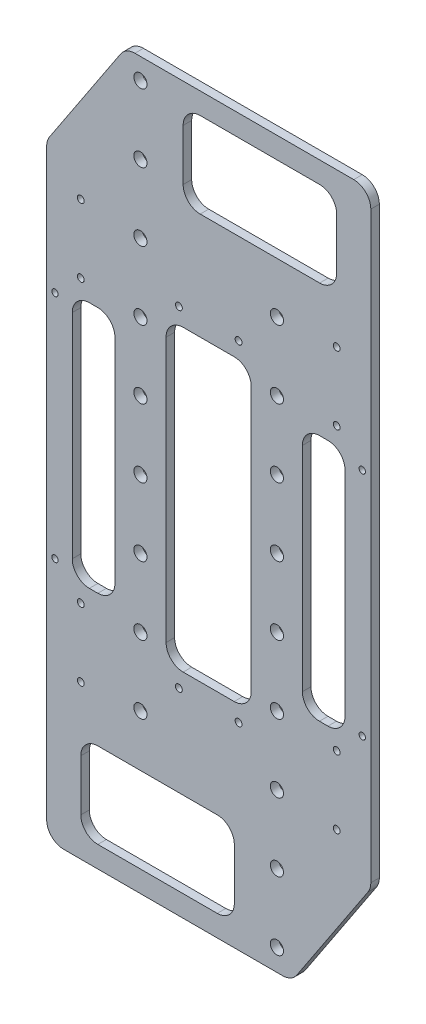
ISO-10303-21;
HEADER;
FILE_DESCRIPTION(('STEP AP214'),'2;1');
FILE_NAME('part.step','',(''),(''),'','','');
FILE_SCHEMA(('AUTOMOTIVE_DESIGN { 1 0 10303 214 1 1 1 1 }'));
ENDSEC;
DATA;
#1=APPLICATION_CONTEXT('core data for automotive mechanical design processes');
#2=APPLICATION_PROTOCOL_DEFINITION('international standard','automotive_design',2000,#1);
#3=PRODUCT_CONTEXT('',#1,'mechanical');
#4=PRODUCT('Part','Part','',(#3));
#5=PRODUCT_RELATED_PRODUCT_CATEGORY('part','',(#4));
#6=PRODUCT_DEFINITION_FORMATION('','',#4);
#7=PRODUCT_DEFINITION_CONTEXT('part definition',#1,'design');
#8=PRODUCT_DEFINITION('design','',#6,#7);
#9=PRODUCT_DEFINITION_SHAPE('','',#8);
#10=(LENGTH_UNIT() NAMED_UNIT(*) SI_UNIT(.MILLI.,.METRE.));
#11=(NAMED_UNIT(*) PLANE_ANGLE_UNIT() SI_UNIT($,.RADIAN.));
#12=(NAMED_UNIT(*) SI_UNIT($,.STERADIAN.) SOLID_ANGLE_UNIT());
#13=UNCERTAINTY_MEASURE_WITH_UNIT(LENGTH_MEASURE(1.E-05),#10,'distance_accuracy_value','');
#14=(GEOMETRIC_REPRESENTATION_CONTEXT(3) GLOBAL_UNCERTAINTY_ASSIGNED_CONTEXT((#13)) GLOBAL_UNIT_ASSIGNED_CONTEXT((#10,
#11,#12)) REPRESENTATION_CONTEXT('',''));
#15=CARTESIAN_POINT('',(0.,0.,0.));
#16=DIRECTION('',(0.,0.,1.));
#17=DIRECTION('',(1.,0.,0.));
#18=AXIS2_PLACEMENT_3D('',#15,#16,#17);
#19=CARTESIAN_POINT('',(0.,0.,6.35));
#20=DIRECTION('',(0.,0.,-1.));
#21=DIRECTION('',(-1.,0.,0.));
#22=AXIS2_PLACEMENT_3D('',#19,#20,#21);
#23=PLANE('',#22);
#24=CARTESIAN_POINT('',(234.95,184.15,6.35));
#25=DIRECTION('',(0.,0.,1.));
#26=DIRECTION('',(1.,0.,0.));
#27=AXIS2_PLACEMENT_3D('',#24,#25,#26);
#28=CIRCLE('',#27,2.38125);
#29=CARTESIAN_POINT('',(237.33125,184.15,6.35));
#30=VERTEX_POINT('',#29);
#31=EDGE_CURVE('E1890',#30,#30,#28,.T.);
#32=ORIENTED_EDGE('',*,*,#31,.F.);
#33=EDGE_LOOP('',(#32));
#34=FACE_BOUND('',#33,.T.);
#35=CARTESIAN_POINT('',(234.95,355.6,6.35));
#36=DIRECTION('',(0.,0.,1.));
#37=DIRECTION('',(1.,0.,0.));
#38=AXIS2_PLACEMENT_3D('',#35,#36,#37);
#39=CIRCLE('',#38,2.38125);
#40=CARTESIAN_POINT('',(237.33125,355.6,6.35));
#41=VERTEX_POINT('',#40);
#42=EDGE_CURVE('E1884',#41,#41,#39,.T.);
#43=ORIENTED_EDGE('',*,*,#42,.F.);
#44=EDGE_LOOP('',(#43));
#45=FACE_BOUND('',#44,.T.);
#46=CARTESIAN_POINT('',(6.21332349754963,355.6,6.35));
#47=DIRECTION('',(0.,0.,1.));
#48=DIRECTION('',(1.,0.,0.));
#49=AXIS2_PLACEMENT_3D('',#46,#47,#48);
#50=CIRCLE('',#49,2.38124999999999);
#51=CARTESIAN_POINT('',(8.59457349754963,355.6,6.35));
#52=VERTEX_POINT('',#51);
#53=EDGE_CURVE('E1878',#52,#52,#50,.T.);
#54=ORIENTED_EDGE('',*,*,#53,.F.);
#55=EDGE_LOOP('',(#54));
#56=FACE_BOUND('',#55,.T.);
#57=CARTESIAN_POINT('',(6.21332349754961,184.15,6.35));
#58=DIRECTION('',(0.,0.,1.));
#59=DIRECTION('',(1.,0.,0.));
#60=AXIS2_PLACEMENT_3D('',#57,#58,#59);
#61=CIRCLE('',#60,2.38124999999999);
#62=CARTESIAN_POINT('',(8.5945734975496,184.15,6.35));
#63=VERTEX_POINT('',#62);
#64=EDGE_CURVE('E1872',#63,#63,#61,.T.);
#65=ORIENTED_EDGE('',*,*,#64,.F.);
#66=EDGE_LOOP('',(#65));
#67=FACE_BOUND('',#66,.T.);
#68=CARTESIAN_POINT('',(25.4,425.45,6.35));
#69=DIRECTION('',(0.,0.,1.));
#70=DIRECTION('',(1.,0.,0.));
#71=AXIS2_PLACEMENT_3D('',#68,#69,#70);
#72=CIRCLE('',#71,2.5527);
#73=CARTESIAN_POINT('',(27.9527,425.45,6.35));
#74=VERTEX_POINT('',#73);
#75=EDGE_CURVE('E1526',#74,#74,#72,.T.);
#76=ORIENTED_EDGE('',*,*,#75,.F.);
#77=EDGE_LOOP('',(#76));
#78=FACE_BOUND('',#77,.T.);
#79=CARTESIAN_POINT('',(215.9,374.65,6.35));
#80=DIRECTION('',(0.,0.,1.));
#81=DIRECTION('',(1.,0.,0.));
#82=AXIS2_PLACEMENT_3D('',#79,#80,#81);
#83=CIRCLE('',#82,2.55269999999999);
#84=CARTESIAN_POINT('',(218.4527,374.65,6.35));
#85=VERTEX_POINT('',#84);
#86=EDGE_CURVE('E1523',#85,#85,#83,.T.);
#87=ORIENTED_EDGE('',*,*,#86,.F.);
#88=EDGE_LOOP('',(#87));
#89=FACE_BOUND('',#88,.T.);
#90=CARTESIAN_POINT('',(215.9,425.45,6.35));
#91=DIRECTION('',(0.,0.,1.));
#92=DIRECTION('',(1.,0.,0.));
#93=AXIS2_PLACEMENT_3D('',#90,#91,#92);
#94=CIRCLE('',#93,2.55269999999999);
#95=CARTESIAN_POINT('',(218.4527,425.45,6.35));
#96=VERTEX_POINT('',#95);
#97=EDGE_CURVE('E1535',#96,#96,#94,.T.);
#98=ORIENTED_EDGE('',*,*,#97,.F.);
#99=EDGE_LOOP('',(#98));
#100=FACE_BOUND('',#99,.T.);
#101=CARTESIAN_POINT('',(215.9,165.1381,6.35));
#102=DIRECTION('',(0.,0.,1.));
#103=DIRECTION('',(1.,0.,0.));
#104=AXIS2_PLACEMENT_3D('',#101,#102,#103);
#105=CIRCLE('',#104,2.55269999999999);
#106=CARTESIAN_POINT('',(218.4527,165.1381,6.35));
#107=VERTEX_POINT('',#106);
#108=EDGE_CURVE('E1541',#107,#107,#105,.T.);
#109=ORIENTED_EDGE('',*,*,#108,.F.);
#110=EDGE_LOOP('',(#109));
#111=FACE_BOUND('',#110,.T.);
#112=CARTESIAN_POINT('',(215.9,114.3381,6.35));
#113=DIRECTION('',(0.,0.,1.));
#114=DIRECTION('',(1.,0.,0.));
#115=AXIS2_PLACEMENT_3D('',#112,#113,#114);
#116=CIRCLE('',#115,2.55269999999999);
#117=CARTESIAN_POINT('',(218.4527,114.3381,6.35));
#118=VERTEX_POINT('',#117);
#119=EDGE_CURVE('E1547',#118,#118,#116,.T.);
#120=ORIENTED_EDGE('',*,*,#119,.F.);
#121=EDGE_LOOP('',(#120));
#122=FACE_BOUND('',#121,.T.);
#123=CARTESIAN_POINT('',(25.4,114.3,6.35));
#124=DIRECTION('',(0.,0.,1.));
#125=DIRECTION('',(1.,0.,0.));
#126=AXIS2_PLACEMENT_3D('',#123,#124,#125);
#127=CIRCLE('',#126,2.5527);
#128=CARTESIAN_POINT('',(27.9527,114.3,6.35));
#129=VERTEX_POINT('',#128);
#130=EDGE_CURVE('E1553',#129,#129,#127,.T.);
#131=ORIENTED_EDGE('',*,*,#130,.F.);
#132=EDGE_LOOP('',(#131));
#133=FACE_BOUND('',#132,.T.);
#134=CARTESIAN_POINT('',(25.4,165.1,6.35));
#135=DIRECTION('',(0.,0.,1.));
#136=DIRECTION('',(1.,0.,0.));
#137=AXIS2_PLACEMENT_3D('',#134,#135,#136);
#138=CIRCLE('',#137,2.5527);
#139=CARTESIAN_POINT('',(27.9527,165.1,6.35));
#140=VERTEX_POINT('',#139);
#141=EDGE_CURVE('E1559',#140,#140,#138,.T.);
#142=ORIENTED_EDGE('',*,*,#141,.F.);
#143=EDGE_LOOP('',(#142));
#144=FACE_BOUND('',#143,.T.);
#145=CARTESIAN_POINT('',(98.425,146.84375,6.35));
#146=DIRECTION('',(0.,0.,1.));
#147=DIRECTION('',(1.,0.,0.));
#148=AXIS2_PLACEMENT_3D('',#145,#146,#147);
#149=CIRCLE('',#148,2.55270000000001);
#150=CARTESIAN_POINT('',(100.9777,146.84375,6.35));
#151=VERTEX_POINT('',#150);
#152=EDGE_CURVE('E1565',#151,#151,#149,.T.);
#153=ORIENTED_EDGE('',*,*,#152,.F.);
#154=EDGE_LOOP('',(#153));
#155=FACE_BOUND('',#154,.T.);
#156=CARTESIAN_POINT('',(142.875,146.84375,6.35));
#157=DIRECTION('',(0.,0.,1.));
#158=DIRECTION('',(1.,0.,0.));
#159=AXIS2_PLACEMENT_3D('',#156,#157,#158);
#160=CIRCLE('',#159,2.55269999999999);
#161=CARTESIAN_POINT('',(145.4277,146.84375,6.35));
#162=VERTEX_POINT('',#161);
#163=EDGE_CURVE('E1571',#162,#162,#160,.T.);
#164=ORIENTED_EDGE('',*,*,#163,.F.);
#165=EDGE_LOOP('',(#164));
#166=FACE_BOUND('',#165,.T.);
#167=CARTESIAN_POINT('',(98.425,392.90625,6.35));
#168=DIRECTION('',(0.,0.,1.));
#169=DIRECTION('',(1.,0.,0.));
#170=AXIS2_PLACEMENT_3D('',#167,#168,#169);
#171=CIRCLE('',#170,2.55270000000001);
#172=CARTESIAN_POINT('',(100.9777,392.90625,6.35));
#173=VERTEX_POINT('',#172);
#174=EDGE_CURVE('E1577',#173,#173,#171,.T.);
#175=ORIENTED_EDGE('',*,*,#174,.F.);
#176=EDGE_LOOP('',(#175));
#177=FACE_BOUND('',#176,.T.);
#178=CARTESIAN_POINT('',(69.7816617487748,524.1544,6.35));
#179=DIRECTION('',(0.,0.,1.));
#180=DIRECTION('',(1.,0.,0.));
#181=AXIS2_PLACEMENT_3D('',#178,#179,#180);
#182=CIRCLE('',#181,4.90219999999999);
#183=CARTESIAN_POINT('',(74.6838617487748,524.1544,6.35));
#184=VERTEX_POINT('',#183);
#185=EDGE_CURVE('E1431',#184,#184,#182,.T.);
#186=ORIENTED_EDGE('',*,*,#185,.F.);
#187=EDGE_LOOP('',(#186));
#188=FACE_BOUND('',#187,.T.);
#189=CARTESIAN_POINT('',(69.7816617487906,117.7544,6.35));
#190=DIRECTION('',(0.,0.,1.));
#191=DIRECTION('',(1.,0.,0.));
#192=AXIS2_PLACEMENT_3D('',#189,#190,#191);
#193=CIRCLE('',#192,4.90219999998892);
#194=CARTESIAN_POINT('',(74.6838617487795,117.7544,6.35));
#195=VERTEX_POINT('',#194);
#196=EDGE_CURVE('E1594',#195,#195,#193,.T.);
#197=ORIENTED_EDGE('',*,*,#196,.F.);
#198=EDGE_LOOP('',(#197));
#199=FACE_BOUND('',#198,.T.);
#200=CARTESIAN_POINT('',(171.381661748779,422.5544,6.35));
#201=DIRECTION('',(0.,0.,1.));
#202=DIRECTION('',(1.,0.,0.));
#203=AXIS2_PLACEMENT_3D('',#200,#201,#202);
#204=CIRCLE('',#203,4.90219999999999);
#205=CARTESIAN_POINT('',(176.283861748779,422.5544,6.35));
#206=VERTEX_POINT('',#205);
#207=EDGE_CURVE('E1593',#206,#206,#204,.T.);
#208=ORIENTED_EDGE('',*,*,#207,.F.);
#209=EDGE_LOOP('',(#208));
#210=FACE_BOUND('',#209,.T.);
#211=CARTESIAN_POINT('',(171.381661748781,371.7544,6.35));
#212=DIRECTION('',(0.,0.,1.));
#213=DIRECTION('',(1.,0.,0.));
#214=AXIS2_PLACEMENT_3D('',#211,#212,#213);
#215=CIRCLE('',#214,4.90219999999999);
#216=CARTESIAN_POINT('',(176.283861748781,371.7544,6.35));
#217=VERTEX_POINT('',#216);
#218=EDGE_CURVE('E1653',#217,#217,#215,.T.);
#219=ORIENTED_EDGE('',*,*,#218,.F.);
#220=EDGE_LOOP('',(#219));
#221=FACE_BOUND('',#220,.T.);
#222=CARTESIAN_POINT('',(171.381661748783,320.9544,6.35));
#223=DIRECTION('',(0.,0.,1.));
#224=DIRECTION('',(1.,0.,0.));
#225=AXIS2_PLACEMENT_3D('',#222,#223,#224);
#226=CIRCLE('',#225,4.90219999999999);
#227=CARTESIAN_POINT('',(176.283861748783,320.9544,6.35));
#228=VERTEX_POINT('',#227);
#229=EDGE_CURVE('E1659',#228,#228,#226,.T.);
#230=ORIENTED_EDGE('',*,*,#229,.F.);
#231=EDGE_LOOP('',(#230));
#232=FACE_BOUND('',#231,.T.);
#233=CARTESIAN_POINT('',(171.381661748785,270.1544,6.35));
#234=DIRECTION('',(0.,0.,1.));
#235=DIRECTION('',(1.,0.,0.));
#236=AXIS2_PLACEMENT_3D('',#233,#234,#235);
#237=CIRCLE('',#236,4.90219999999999);
#238=CARTESIAN_POINT('',(176.283861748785,270.1544,6.35));
#239=VERTEX_POINT('',#238);
#240=EDGE_CURVE('E1665',#239,#239,#237,.T.);
#241=ORIENTED_EDGE('',*,*,#240,.F.);
#242=EDGE_LOOP('',(#241));
#243=FACE_BOUND('',#242,.T.);
#244=CARTESIAN_POINT('',(171.381661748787,219.3544,6.35));
#245=DIRECTION('',(0.,0.,1.));
#246=DIRECTION('',(1.,0.,0.));
#247=AXIS2_PLACEMENT_3D('',#244,#245,#246);
#248=CIRCLE('',#247,4.90219999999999);
#249=CARTESIAN_POINT('',(176.283861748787,219.3544,6.35));
#250=VERTEX_POINT('',#249);
#251=EDGE_CURVE('E1671',#250,#250,#248,.T.);
#252=ORIENTED_EDGE('',*,*,#251,.F.);
#253=EDGE_LOOP('',(#252));
#254=FACE_BOUND('',#253,.T.);
#255=CARTESIAN_POINT('',(171.381661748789,168.5544,6.35));
#256=DIRECTION('',(0.,0.,1.));
#257=DIRECTION('',(1.,0.,0.));
#258=AXIS2_PLACEMENT_3D('',#255,#256,#257);
#259=CIRCLE('',#258,4.90219999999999);
#260=CARTESIAN_POINT('',(176.283861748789,168.5544,6.35));
#261=VERTEX_POINT('',#260);
#262=EDGE_CURVE('E1677',#261,#261,#259,.T.);
#263=ORIENTED_EDGE('',*,*,#262,.F.);
#264=EDGE_LOOP('',(#263));
#265=FACE_BOUND('',#264,.T.);
#266=CARTESIAN_POINT('',(171.381661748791,117.7544,6.35));
#267=DIRECTION('',(0.,0.,1.));
#268=DIRECTION('',(1.,0.,0.));
#269=AXIS2_PLACEMENT_3D('',#266,#267,#268);
#270=CIRCLE('',#269,4.90219999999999);
#271=CARTESIAN_POINT('',(176.283861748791,117.7544,6.35));
#272=VERTEX_POINT('',#271);
#273=EDGE_CURVE('E1683',#272,#272,#270,.T.);
#274=ORIENTED_EDGE('',*,*,#273,.F.);
#275=EDGE_LOOP('',(#274));
#276=FACE_BOUND('',#275,.T.);
#277=CARTESIAN_POINT('',(171.381661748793,66.9544,6.35));
#278=DIRECTION('',(0.,0.,1.));
#279=DIRECTION('',(1.,0.,0.));
#280=AXIS2_PLACEMENT_3D('',#277,#278,#279);
#281=CIRCLE('',#280,4.90219999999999);
#282=CARTESIAN_POINT('',(176.283861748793,66.9544,6.35));
#283=VERTEX_POINT('',#282);
#284=EDGE_CURVE('E1689',#283,#283,#281,.T.);
#285=ORIENTED_EDGE('',*,*,#284,.F.);
#286=EDGE_LOOP('',(#285));
#287=FACE_BOUND('',#286,.T.);
#288=CARTESIAN_POINT('',(69.7816617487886,168.5544,6.35));
#289=DIRECTION('',(0.,0.,1.));
#290=DIRECTION('',(1.,0.,0.));
#291=AXIS2_PLACEMENT_3D('',#288,#289,#290);
#292=CIRCLE('',#291,4.90219999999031);
#293=CARTESIAN_POINT('',(74.683861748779,168.5544,6.35));
#294=VERTEX_POINT('',#293);
#295=EDGE_CURVE('E1619',#294,#294,#292,.T.);
#296=ORIENTED_EDGE('',*,*,#295,.F.);
#297=EDGE_LOOP('',(#296));
#298=FACE_BOUND('',#297,.T.);
#299=CARTESIAN_POINT('',(69.7816617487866,219.3544,6.35));
#300=DIRECTION('',(0.,0.,1.));
#301=DIRECTION('',(1.,0.,0.));
#302=AXIS2_PLACEMENT_3D('',#299,#300,#301);
#303=CIRCLE('',#302,4.9021999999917);
#304=CARTESIAN_POINT('',(74.6838617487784,219.3544,6.35));
#305=VERTEX_POINT('',#304);
#306=EDGE_CURVE('E1613',#305,#305,#303,.T.);
#307=ORIENTED_EDGE('',*,*,#306,.F.);
#308=EDGE_LOOP('',(#307));
#309=FACE_BOUND('',#308,.T.);
#310=CARTESIAN_POINT('',(69.7816617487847,270.1544,6.35));
#311=DIRECTION('',(0.,0.,1.));
#312=DIRECTION('',(1.,0.,0.));
#313=AXIS2_PLACEMENT_3D('',#310,#311,#312);
#314=CIRCLE('',#313,4.90219999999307);
#315=CARTESIAN_POINT('',(74.6838617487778,270.1544,6.35));
#316=VERTEX_POINT('',#315);
#317=EDGE_CURVE('E1607',#316,#316,#314,.T.);
#318=ORIENTED_EDGE('',*,*,#317,.F.);
#319=EDGE_LOOP('',(#318));
#320=FACE_BOUND('',#319,.T.);
#321=CARTESIAN_POINT('',(69.7816617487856,320.9544,6.35));
#322=DIRECTION('',(0.,0.,1.));
#323=DIRECTION('',(1.,0.,0.));
#324=AXIS2_PLACEMENT_3D('',#321,#322,#323);
#325=CIRCLE('',#324,4.90219999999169);
#326=CARTESIAN_POINT('',(74.6838617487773,320.9544,6.35));
#327=VERTEX_POINT('',#326);
#328=EDGE_CURVE('E1600',#327,#327,#325,.T.);
#329=ORIENTED_EDGE('',*,*,#328,.F.);
#330=EDGE_LOOP('',(#329));
#331=FACE_BOUND('',#330,.T.);
#332=CARTESIAN_POINT('',(171.381661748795,16.1544,6.35));
#333=DIRECTION('',(0.,0.,1.));
#334=DIRECTION('',(1.,0.,0.));
#335=AXIS2_PLACEMENT_3D('',#332,#333,#334);
#336=CIRCLE('',#335,4.90219999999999);
#337=CARTESIAN_POINT('',(176.283861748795,16.1544,6.35));
#338=VERTEX_POINT('',#337);
#339=EDGE_CURVE('E1636',#338,#338,#336,.T.);
#340=ORIENTED_EDGE('',*,*,#339,.F.);
#341=EDGE_LOOP('',(#340));
#342=FACE_BOUND('',#341,.T.);
#343=CARTESIAN_POINT('',(69.7816617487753,473.3544,6.35));
#344=DIRECTION('',(0.,0.,1.));
#345=DIRECTION('',(1.,0.,0.));
#346=AXIS2_PLACEMENT_3D('',#343,#344,#345);
#347=CIRCLE('',#346,4.9022);
#348=CARTESIAN_POINT('',(74.6838617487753,473.3544,6.35));
#349=VERTEX_POINT('',#348);
#350=EDGE_CURVE('E1643',#349,#349,#347,.T.);
#351=ORIENTED_EDGE('',*,*,#350,.F.);
#352=EDGE_LOOP('',(#351));
#353=FACE_BOUND('',#352,.T.);
#354=CARTESIAN_POINT('',(69.7816617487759,422.5544,6.35));
#355=DIRECTION('',(0.,0.,1.));
#356=DIRECTION('',(1.,0.,0.));
#357=AXIS2_PLACEMENT_3D('',#354,#355,#356);
#358=CIRCLE('',#357,4.9022);
#359=CARTESIAN_POINT('',(74.6838617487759,422.5544,6.35));
#360=VERTEX_POINT('',#359);
#361=EDGE_CURVE('E1624',#360,#360,#358,.T.);
#362=ORIENTED_EDGE('',*,*,#361,.F.);
#363=EDGE_LOOP('',(#362));
#364=FACE_BOUND('',#363,.T.);
#365=CARTESIAN_POINT('',(69.7816617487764,371.7544,6.35));
#366=DIRECTION('',(0.,0.,1.));
#367=DIRECTION('',(1.,0.,0.));
#368=AXIS2_PLACEMENT_3D('',#365,#366,#367);
#369=CIRCLE('',#368,4.9022);
#370=CARTESIAN_POINT('',(74.6838617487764,371.7544,6.35));
#371=VERTEX_POINT('',#370);
#372=EDGE_CURVE('E1631',#371,#371,#369,.T.);
#373=ORIENTED_EDGE('',*,*,#372,.F.);
#374=EDGE_LOOP('',(#373));
#375=FACE_BOUND('',#374,.T.);
#376=DIRECTION('',(0.,-1.,0.));
#377=VECTOR('',#376,1.);
#378=CARTESIAN_POINT('',(190.36332349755,177.8,6.35));
#379=LINE('',#378,#377);
#380=CARTESIAN_POINT('',(190.36332349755,349.25,6.35));
#381=VERTEX_POINT('',#380);
#382=CARTESIAN_POINT('',(190.36332349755,190.5,6.35));
#383=VERTEX_POINT('',#382);
#384=EDGE_CURVE('E1438',#381,#383,#379,.T.);
#385=ORIENTED_EDGE('',*,*,#384,.F.);
#386=CARTESIAN_POINT('',(203.06332349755,349.25,6.35));
#387=DIRECTION('',(0.,0.,-1.));
#388=DIRECTION('',(-1.,0.,0.));
#389=AXIS2_PLACEMENT_3D('',#386,#387,#388);
#390=CIRCLE('',#389,12.7);
#391=CARTESIAN_POINT('',(203.06332349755,361.95,6.35));
#392=VERTEX_POINT('',#391);
#393=EDGE_CURVE('E604',#381,#392,#390,.T.);
#394=ORIENTED_EDGE('',*,*,#393,.T.);
#395=DIRECTION('',(-1.,0.,0.));
#396=VECTOR('',#395,1.);
#397=CARTESIAN_POINT('',(190.36332349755,361.95,6.35));
#398=LINE('',#397,#396);
#399=CARTESIAN_POINT('',(209.41332349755,361.95,6.35));
#400=VERTEX_POINT('',#399);
#401=EDGE_CURVE('E1448',#400,#392,#398,.T.);
#402=ORIENTED_EDGE('',*,*,#401,.F.);
#403=CARTESIAN_POINT('',(209.41332349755,349.25,6.35));
#404=DIRECTION('',(0.,0.,-1.));
#405=DIRECTION('',(-1.,0.,0.));
#406=AXIS2_PLACEMENT_3D('',#403,#404,#405);
#407=CIRCLE('',#406,12.7);
#408=CARTESIAN_POINT('',(222.11332349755,349.25,6.35));
#409=VERTEX_POINT('',#408);
#410=EDGE_CURVE('E600',#400,#409,#407,.T.);
#411=ORIENTED_EDGE('',*,*,#410,.T.);
#412=DIRECTION('',(0.,1.,0.));
#413=VECTOR('',#412,1.);
#414=CARTESIAN_POINT('',(222.11332349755,361.95,6.35));
#415=LINE('',#414,#413);
#416=CARTESIAN_POINT('',(222.11332349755,190.5,6.35));
#417=VERTEX_POINT('',#416);
#418=EDGE_CURVE('E1445',#417,#409,#415,.T.);
#419=ORIENTED_EDGE('',*,*,#418,.F.);
#420=CARTESIAN_POINT('',(209.41332349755,190.5,6.35));
#421=DIRECTION('',(0.,0.,-1.));
#422=DIRECTION('',(-1.,0.,0.));
#423=AXIS2_PLACEMENT_3D('',#420,#421,#422);
#424=CIRCLE('',#423,12.7);
#425=CARTESIAN_POINT('',(209.41332349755,177.8,6.35));
#426=VERTEX_POINT('',#425);
#427=EDGE_CURVE('E596',#417,#426,#424,.T.);
#428=ORIENTED_EDGE('',*,*,#427,.T.);
#429=DIRECTION('',(1.,0.,0.));
#430=VECTOR('',#429,1.);
#431=CARTESIAN_POINT('',(222.11332349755,177.8,6.35));
#432=LINE('',#431,#430);
#433=CARTESIAN_POINT('',(203.06332349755,177.8,6.35));
#434=VERTEX_POINT('',#433);
#435=EDGE_CURVE('E1441',#434,#426,#432,.T.);
#436=ORIENTED_EDGE('',*,*,#435,.F.);
#437=CARTESIAN_POINT('',(203.06332349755,190.5,6.35));
#438=DIRECTION('',(0.,0.,-1.));
#439=DIRECTION('',(-1.,0.,0.));
#440=AXIS2_PLACEMENT_3D('',#437,#438,#439);
#441=CIRCLE('',#440,12.7);
#442=EDGE_CURVE('E592',#434,#383,#441,.T.);
#443=ORIENTED_EDGE('',*,*,#442,.T.);
#444=EDGE_LOOP('',(#385,#394,#402,#411,#419,#428,#436,#443));
#445=FACE_BOUND('',#444,.T.);
#446=DIRECTION('',(0.,-1.,0.));
#447=VECTOR('',#446,1.);
#448=CARTESIAN_POINT('',(101.6,523.875,6.35));
#449=LINE('',#448,#447);
#450=CARTESIAN_POINT('',(101.6,511.175,6.35));
#451=VERTEX_POINT('',#450);
#452=CARTESIAN_POINT('',(101.6,473.075,6.35));
#453=VERTEX_POINT('',#452);
#454=EDGE_CURVE('E660',#451,#453,#449,.T.);
#455=ORIENTED_EDGE('',*,*,#454,.F.);
#456=CARTESIAN_POINT('',(114.3,511.175,6.35));
#457=DIRECTION('',(0.,0.,-1.));
#458=DIRECTION('',(-1.,0.,0.));
#459=AXIS2_PLACEMENT_3D('',#456,#457,#458);
#460=CIRCLE('',#459,12.7);
#461=CARTESIAN_POINT('',(114.3,523.875,6.35));
#462=VERTEX_POINT('',#461);
#463=EDGE_CURVE('E11',#451,#462,#460,.T.);
#464=ORIENTED_EDGE('',*,*,#463,.T.);
#465=DIRECTION('',(-1.,0.,0.));
#466=VECTOR('',#465,1.);
#467=CARTESIAN_POINT('',(101.6,523.875,6.35));
#468=LINE('',#467,#466);
#469=CARTESIAN_POINT('',(203.2,523.875,6.35));
#470=VERTEX_POINT('',#469);
#471=EDGE_CURVE('E658',#470,#462,#468,.T.);
#472=ORIENTED_EDGE('',*,*,#471,.F.);
#473=CARTESIAN_POINT('',(203.2,511.175,6.35));
#474=DIRECTION('',(0.,0.,-1.));
#475=DIRECTION('',(-1.,0.,0.));
#476=AXIS2_PLACEMENT_3D('',#473,#474,#475);
#477=CIRCLE('',#476,12.7);
#478=CARTESIAN_POINT('',(215.9,511.175,6.35));
#479=VERTEX_POINT('',#478);
#480=EDGE_CURVE('E627',#470,#479,#477,.T.);
#481=ORIENTED_EDGE('',*,*,#480,.T.);
#482=DIRECTION('',(0.,1.,0.));
#483=VECTOR('',#482,1.);
#484=CARTESIAN_POINT('',(215.9,523.875,6.35));
#485=LINE('',#484,#483);
#486=CARTESIAN_POINT('',(215.9,473.075,6.35));
#487=VERTEX_POINT('',#486);
#488=EDGE_CURVE('E665',#487,#479,#485,.T.);
#489=ORIENTED_EDGE('',*,*,#488,.F.);
#490=CARTESIAN_POINT('',(203.2,473.075,6.35));
#491=DIRECTION('',(0.,0.,-1.));
#492=DIRECTION('',(-1.,0.,0.));
#493=AXIS2_PLACEMENT_3D('',#490,#491,#492);
#494=CIRCLE('',#493,12.7);
#495=CARTESIAN_POINT('',(203.2,460.375,6.35));
#496=VERTEX_POINT('',#495);
#497=EDGE_CURVE('E623',#487,#496,#494,.T.);
#498=ORIENTED_EDGE('',*,*,#497,.T.);
#499=DIRECTION('',(1.,0.,0.));
#500=VECTOR('',#499,1.);
#501=CARTESIAN_POINT('',(101.6,460.375,6.35));
#502=LINE('',#501,#500);
#503=CARTESIAN_POINT('',(114.3,460.375,6.35));
#504=VERTEX_POINT('',#503);
#505=EDGE_CURVE('E671',#504,#496,#502,.T.);
#506=ORIENTED_EDGE('',*,*,#505,.F.);
#507=CARTESIAN_POINT('',(114.3,473.075,6.35));
#508=DIRECTION('',(0.,0.,-1.));
#509=DIRECTION('',(-1.,0.,0.));
#510=AXIS2_PLACEMENT_3D('',#507,#508,#509);
#511=CIRCLE('',#510,12.7);
#512=EDGE_CURVE('E631',#504,#453,#511,.T.);
#513=ORIENTED_EDGE('',*,*,#512,.T.);
#514=EDGE_LOOP('',(#455,#464,#472,#481,#489,#498,#506,#513));
#515=FACE_BOUND('',#514,.T.);
#516=DIRECTION('',(0.,-1.,0.));
#517=VECTOR('',#516,1.);
#518=CARTESIAN_POINT('',(0.,0.,6.35));
#519=LINE('',#518,#517);
#520=CARTESIAN_POINT('',(0.,447.025807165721,6.35));
#521=VERTEX_POINT('',#520);
#522=CARTESIAN_POINT('',(0.,12.7,6.35));
#523=VERTEX_POINT('',#522);
#524=EDGE_CURVE('E402',#521,#523,#519,.T.);
#525=ORIENTED_EDGE('',*,*,#524,.T.);
#526=CARTESIAN_POINT('',(12.7,12.7,6.35));
#527=DIRECTION('',(0.,0.,-1.));
#528=DIRECTION('',(-1.,0.,0.));
#529=AXIS2_PLACEMENT_3D('',#526,#527,#528);
#530=CIRCLE('',#529,12.7);
#531=CARTESIAN_POINT('',(12.7,0.,6.35));
#532=VERTEX_POINT('',#531);
#533=EDGE_CURVE('E437',#523,#532,#530,.F.);
#534=ORIENTED_EDGE('',*,*,#533,.T.);
#535=DIRECTION('',(1.,0.,0.));
#536=VECTOR('',#535,1.);
#537=CARTESIAN_POINT('',(182.4228,0.,6.35));
#538=LINE('',#537,#536);
#539=CARTESIAN_POINT('',(175.601120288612,0.,6.35));
#540=VERTEX_POINT('',#539);
#541=EDGE_CURVE('E385',#532,#540,#538,.T.);
#542=ORIENTED_EDGE('',*,*,#541,.T.);
#543=CARTESIAN_POINT('',(175.601120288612,12.7,6.35));
#544=DIRECTION('',(0.,0.,-1.));
#545=DIRECTION('',(-1.,0.,0.));
#546=AXIS2_PLACEMENT_3D('',#543,#544,#545);
#547=CIRCLE('',#546,12.7);
#548=CARTESIAN_POINT('',(186.189519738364,5.68745430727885,6.35));
#549=VERTEX_POINT('',#548);
#550=EDGE_CURVE('E435',#540,#549,#547,.F.);
#551=ORIENTED_EDGE('',*,*,#550,.T.);
#552=DIRECTION('',(0.552168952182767,0.833732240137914,0.));
#553=VECTOR('',#552,1.);
#554=CARTESIAN_POINT('',(241.3,88.9,6.35));
#555=LINE('',#554,#553);
#556=CARTESIAN_POINT('',(239.188399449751,85.7116471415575,6.35));
#557=VERTEX_POINT('',#556);
#558=EDGE_CURVE('E697',#549,#557,#555,.T.);
#559=ORIENTED_EDGE('',*,*,#558,.T.);
#560=CARTESIAN_POINT('',(228.6,92.7241928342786,6.35));
#561=DIRECTION('',(0.,0.,-1.));
#562=DIRECTION('',(-1.,0.,0.));
#563=AXIS2_PLACEMENT_3D('',#560,#561,#562);
#564=CIRCLE('',#563,12.7);
#565=CARTESIAN_POINT('',(241.3,92.7241928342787,6.35));
#566=VERTEX_POINT('',#565);
#567=EDGE_CURVE('E433',#557,#566,#564,.F.);
#568=ORIENTED_EDGE('',*,*,#567,.T.);
#569=DIRECTION('',(0.,1.,0.));
#570=VECTOR('',#569,1.);
#571=CARTESIAN_POINT('',(241.3,539.75,6.35));
#572=LINE('',#571,#570);
#573=CARTESIAN_POINT('',(241.3,527.05,6.35));
#574=VERTEX_POINT('',#573);
#575=EDGE_CURVE('E700',#566,#574,#572,.T.);
#576=ORIENTED_EDGE('',*,*,#575,.T.);
#577=CARTESIAN_POINT('',(228.6,527.05,6.35));
#578=DIRECTION('',(0.,0.,-1.));
#579=DIRECTION('',(-1.,0.,0.));
#580=AXIS2_PLACEMENT_3D('',#577,#578,#579);
#581=CIRCLE('',#580,12.7);
#582=CARTESIAN_POINT('',(228.6,539.75,6.35));
#583=VERTEX_POINT('',#582);
#584=EDGE_CURVE('E429',#574,#583,#581,.F.);
#585=ORIENTED_EDGE('',*,*,#584,.T.);
#586=DIRECTION('',(-1.,0.,0.));
#587=VECTOR('',#586,1.);
#588=CARTESIAN_POINT('',(58.8772,539.75,6.35));
#589=LINE('',#588,#587);
#590=CARTESIAN_POINT('',(65.6988797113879,539.75,6.35));
#591=VERTEX_POINT('',#590);
#592=EDGE_CURVE('E703',#583,#591,#589,.T.);
#593=ORIENTED_EDGE('',*,*,#592,.T.);
#594=CARTESIAN_POINT('',(65.6988797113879,527.05,6.35));
#595=DIRECTION('',(0.,0.,-1.));
#596=DIRECTION('',(-1.,0.,0.));
#597=AXIS2_PLACEMENT_3D('',#594,#595,#596);
#598=CIRCLE('',#597,12.7);
#599=CARTESIAN_POINT('',(55.1104802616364,534.062545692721,6.35));
#600=VERTEX_POINT('',#599);
#601=EDGE_CURVE('E427',#591,#600,#598,.F.);
#602=ORIENTED_EDGE('',*,*,#601,.T.);
#603=DIRECTION('',(-0.552168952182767,-0.833732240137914,0.));
#604=VECTOR('',#603,1.);
#605=CARTESIAN_POINT('',(0.,450.85,6.35));
#606=LINE('',#605,#604);
#607=CARTESIAN_POINT('',(2.11160055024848,454.038352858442,6.35));
#608=VERTEX_POINT('',#607);
#609=EDGE_CURVE('E705',#600,#608,#606,.T.);
#610=ORIENTED_EDGE('',*,*,#609,.T.);
#611=CARTESIAN_POINT('',(12.7,447.025807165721,6.35));
#612=DIRECTION('',(0.,0.,-1.));
#613=DIRECTION('',(-1.,0.,0.));
#614=AXIS2_PLACEMENT_3D('',#611,#612,#613);
#615=CIRCLE('',#614,12.7);
#616=EDGE_CURVE('E431',#608,#521,#615,.F.);
#617=ORIENTED_EDGE('',*,*,#616,.T.);
#618=EDGE_LOOP('',(#525,#534,#542,#551,#559,#568,#576,#585,#593,#602,#610,#617));
#619=FACE_BOUND('',#618,.T.);
#620=DIRECTION('',(0.,-1.,0.));
#621=VECTOR('',#620,1.);
#622=CARTESIAN_POINT('',(25.4,79.375,6.35));
#623=LINE('',#622,#621);
#624=CARTESIAN_POINT('',(25.4,66.675,6.35));
#625=VERTEX_POINT('',#624);
#626=CARTESIAN_POINT('',(25.4,28.575,6.35));
#627=VERTEX_POINT('',#626);
#628=EDGE_CURVE('E680',#625,#627,#623,.T.);
#629=ORIENTED_EDGE('',*,*,#628,.F.);
#630=CARTESIAN_POINT('',(38.1,66.675,6.35));
#631=DIRECTION('',(0.,0.,-1.));
#632=DIRECTION('',(-1.,0.,0.));
#633=AXIS2_PLACEMENT_3D('',#630,#631,#632);
#634=CIRCLE('',#633,12.7);
#635=CARTESIAN_POINT('',(38.1,79.375,6.35));
#636=VERTEX_POINT('',#635);
#637=EDGE_CURVE('E564',#625,#636,#634,.T.);
#638=ORIENTED_EDGE('',*,*,#637,.T.);
#639=DIRECTION('',(-1.,0.,0.));
#640=VECTOR('',#639,1.);
#641=CARTESIAN_POINT('',(25.4,79.375,6.35));
#642=LINE('',#641,#640);
#643=CARTESIAN_POINT('',(127.,79.375,6.35));
#644=VERTEX_POINT('',#643);
#645=EDGE_CURVE('E393',#644,#636,#642,.T.);
#646=ORIENTED_EDGE('',*,*,#645,.F.);
#647=CARTESIAN_POINT('',(127.,66.675,6.35));
#648=DIRECTION('',(0.,0.,-1.));
#649=DIRECTION('',(-1.,0.,0.));
#650=AXIS2_PLACEMENT_3D('',#647,#648,#649);
#651=CIRCLE('',#650,12.7);
#652=CARTESIAN_POINT('',(139.7,66.675,6.35));
#653=VERTEX_POINT('',#652);
#654=EDGE_CURVE('E568',#644,#653,#651,.T.);
#655=ORIENTED_EDGE('',*,*,#654,.T.);
#656=DIRECTION('',(0.,1.,0.));
#657=VECTOR('',#656,1.);
#658=CARTESIAN_POINT('',(139.7,79.375,6.35));
#659=LINE('',#658,#657);
#660=CARTESIAN_POINT('',(139.7,28.575,6.35));
#661=VERTEX_POINT('',#660);
#662=EDGE_CURVE('E399',#661,#653,#659,.T.);
#663=ORIENTED_EDGE('',*,*,#662,.F.);
#664=CARTESIAN_POINT('',(127.,28.575,6.35));
#665=DIRECTION('',(0.,0.,-1.));
#666=DIRECTION('',(-1.,0.,0.));
#667=AXIS2_PLACEMENT_3D('',#664,#665,#666);
#668=CIRCLE('',#667,12.7);
#669=CARTESIAN_POINT('',(127.,15.875,6.35));
#670=VERTEX_POINT('',#669);
#671=EDGE_CURVE('E572',#661,#670,#668,.T.);
#672=ORIENTED_EDGE('',*,*,#671,.T.);
#673=DIRECTION('',(1.,0.,0.));
#674=VECTOR('',#673,1.);
#675=CARTESIAN_POINT('',(25.4,15.875,6.35));
#676=LINE('',#675,#674);
#677=CARTESIAN_POINT('',(38.1,15.875,6.35));
#678=VERTEX_POINT('',#677);
#679=EDGE_CURVE('E683',#678,#670,#676,.T.);
#680=ORIENTED_EDGE('',*,*,#679,.F.);
#681=CARTESIAN_POINT('',(38.1,28.575,6.35));
#682=DIRECTION('',(0.,0.,-1.));
#683=DIRECTION('',(-1.,0.,0.));
#684=AXIS2_PLACEMENT_3D('',#681,#682,#683);
#685=CIRCLE('',#684,12.7);
#686=EDGE_CURVE('E560',#678,#627,#685,.T.);
#687=ORIENTED_EDGE('',*,*,#686,.T.);
#688=EDGE_LOOP('',(#629,#638,#646,#655,#663,#672,#680,#687));
#689=FACE_BOUND('',#688,.T.);
#690=DIRECTION('',(1.,0.,0.));
#691=VECTOR('',#690,1.);
#692=CARTESIAN_POINT('',(88.9,158.75,6.35));
#693=LINE('',#692,#691);
#694=CARTESIAN_POINT('',(101.6,158.75,6.35));
#695=VERTEX_POINT('',#694);
#696=CARTESIAN_POINT('',(139.56332349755,158.75,6.35));
#697=VERTEX_POINT('',#696);
#698=EDGE_CURVE('E1464',#695,#697,#693,.T.);
#699=ORIENTED_EDGE('',*,*,#698,.F.);
#700=CARTESIAN_POINT('',(101.6,171.45,6.35));
#701=DIRECTION('',(0.,0.,-1.));
#702=DIRECTION('',(-1.,0.,0.));
#703=AXIS2_PLACEMENT_3D('',#700,#701,#702);
#704=CIRCLE('',#703,12.7);
#705=CARTESIAN_POINT('',(88.9,171.45,6.35));
#706=VERTEX_POINT('',#705);
#707=EDGE_CURVE('E584',#695,#706,#704,.T.);
#708=ORIENTED_EDGE('',*,*,#707,.T.);
#709=DIRECTION('',(0.,-1.,0.));
#710=VECTOR('',#709,1.);
#711=CARTESIAN_POINT('',(88.9,381.,6.35));
#712=LINE('',#711,#710);
#713=CARTESIAN_POINT('',(88.9,368.3,6.35));
#714=VERTEX_POINT('',#713);
#715=EDGE_CURVE('E650',#714,#706,#712,.T.);
#716=ORIENTED_EDGE('',*,*,#715,.F.);
#717=CARTESIAN_POINT('',(101.6,368.3,6.35));
#718=DIRECTION('',(0.,0.,-1.));
#719=DIRECTION('',(-1.,0.,0.));
#720=AXIS2_PLACEMENT_3D('',#717,#718,#719);
#721=CIRCLE('',#720,12.7);
#722=CARTESIAN_POINT('',(101.6,381.,6.35));
#723=VERTEX_POINT('',#722);
#724=EDGE_CURVE('E612',#714,#723,#721,.T.);
#725=ORIENTED_EDGE('',*,*,#724,.T.);
#726=DIRECTION('',(-1.,0.,0.));
#727=VECTOR('',#726,1.);
#728=CARTESIAN_POINT('',(152.26332349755,381.,6.35));
#729=LINE('',#728,#727);
#730=CARTESIAN_POINT('',(139.56332349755,381.,6.35));
#731=VERTEX_POINT('',#730);
#732=EDGE_CURVE('E1471',#731,#723,#729,.T.);
#733=ORIENTED_EDGE('',*,*,#732,.F.);
#734=CARTESIAN_POINT('',(139.56332349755,368.3,6.35));
#735=DIRECTION('',(0.,0.,-1.));
#736=DIRECTION('',(-1.,0.,0.));
#737=AXIS2_PLACEMENT_3D('',#734,#735,#736);
#738=CIRCLE('',#737,12.7);
#739=CARTESIAN_POINT('',(152.26332349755,368.3,6.35));
#740=VERTEX_POINT('',#739);
#741=EDGE_CURVE('E608',#731,#740,#738,.T.);
#742=ORIENTED_EDGE('',*,*,#741,.T.);
#743=DIRECTION('',(0.,1.,0.));
#744=VECTOR('',#743,1.);
#745=CARTESIAN_POINT('',(152.26332349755,381.,6.35));
#746=LINE('',#745,#744);
#747=CARTESIAN_POINT('',(152.26332349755,171.45,6.35));
#748=VERTEX_POINT('',#747);
#749=EDGE_CURVE('E1467',#748,#740,#746,.T.);
#750=ORIENTED_EDGE('',*,*,#749,.F.);
#751=CARTESIAN_POINT('',(139.56332349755,171.45,6.35));
#752=DIRECTION('',(0.,0.,-1.));
#753=DIRECTION('',(-1.,0.,0.));
#754=AXIS2_PLACEMENT_3D('',#751,#752,#753);
#755=CIRCLE('',#754,12.7);
#756=EDGE_CURVE('E588',#748,#697,#755,.T.);
#757=ORIENTED_EDGE('',*,*,#756,.T.);
#758=EDGE_LOOP('',(#699,#708,#716,#725,#733,#742,#750,#757));
#759=FACE_BOUND('',#758,.T.);
#760=DIRECTION('',(0.,1.,0.));
#761=VECTOR('',#760,1.);
#762=CARTESIAN_POINT('',(50.8,177.8,6.35));
#763=LINE('',#762,#761);
#764=CARTESIAN_POINT('',(50.8,190.5,6.35));
#765=VERTEX_POINT('',#764);
#766=CARTESIAN_POINT('',(50.8,349.25,6.35));
#767=VERTEX_POINT('',#766);
#768=EDGE_CURVE('E1437',#765,#767,#763,.T.);
#769=ORIENTED_EDGE('',*,*,#768,.F.);
#770=CARTESIAN_POINT('',(38.1,190.5,6.35));
#771=DIRECTION('',(0.,0.,-1.));
#772=DIRECTION('',(-1.,0.,0.));
#773=AXIS2_PLACEMENT_3D('',#770,#771,#772);
#774=CIRCLE('',#773,12.7);
#775=CARTESIAN_POINT('',(38.1,177.8,6.35));
#776=VERTEX_POINT('',#775);
#777=EDGE_CURVE('E580',#765,#776,#774,.T.);
#778=ORIENTED_EDGE('',*,*,#777,.T.);
#779=DIRECTION('',(1.,0.,0.));
#780=VECTOR('',#779,1.);
#781=CARTESIAN_POINT('',(19.05,177.8,6.35));
#782=LINE('',#781,#780);
#783=CARTESIAN_POINT('',(31.75,177.8,6.35));
#784=VERTEX_POINT('',#783);
#785=EDGE_CURVE('E1456',#784,#776,#782,.T.);
#786=ORIENTED_EDGE('',*,*,#785,.F.);
#787=CARTESIAN_POINT('',(31.75,190.5,6.35));
#788=DIRECTION('',(0.,0.,-1.));
#789=DIRECTION('',(-1.,0.,0.));
#790=AXIS2_PLACEMENT_3D('',#787,#788,#789);
#791=CIRCLE('',#790,12.7);
#792=CARTESIAN_POINT('',(19.05,190.5,6.35));
#793=VERTEX_POINT('',#792);
#794=EDGE_CURVE('E576',#784,#793,#791,.T.);
#795=ORIENTED_EDGE('',*,*,#794,.T.);
#796=DIRECTION('',(0.,-1.,0.));
#797=VECTOR('',#796,1.);
#798=CARTESIAN_POINT('',(19.05,361.95,6.35));
#799=LINE('',#798,#797);
#800=CARTESIAN_POINT('',(19.05,349.25,6.35));
#801=VERTEX_POINT('',#800);
#802=EDGE_CURVE('E1696',#801,#793,#799,.T.);
#803=ORIENTED_EDGE('',*,*,#802,.F.);
#804=CARTESIAN_POINT('',(31.75,349.25,6.35));
#805=DIRECTION('',(0.,0.,-1.));
#806=DIRECTION('',(-1.,0.,0.));
#807=AXIS2_PLACEMENT_3D('',#804,#805,#806);
#808=CIRCLE('',#807,12.7);
#809=CARTESIAN_POINT('',(31.75,361.95,6.35));
#810=VERTEX_POINT('',#809);
#811=EDGE_CURVE('E50',#801,#810,#808,.T.);
#812=ORIENTED_EDGE('',*,*,#811,.T.);
#813=DIRECTION('',(-1.,0.,0.));
#814=VECTOR('',#813,1.);
#815=CARTESIAN_POINT('',(50.8,361.95,6.35));
#816=LINE('',#815,#814);
#817=CARTESIAN_POINT('',(38.1,361.95,6.35));
#818=VERTEX_POINT('',#817);
#819=EDGE_CURVE('E1420',#818,#810,#816,.T.);
#820=ORIENTED_EDGE('',*,*,#819,.F.);
#821=CARTESIAN_POINT('',(38.1,349.25,6.35));
#822=DIRECTION('',(0.,0.,-1.));
#823=DIRECTION('',(-1.,0.,0.));
#824=AXIS2_PLACEMENT_3D('',#821,#822,#823);
#825=CIRCLE('',#824,12.7);
#826=EDGE_CURVE('E616',#818,#767,#825,.T.);
#827=ORIENTED_EDGE('',*,*,#826,.T.);
#828=EDGE_LOOP('',(#769,#778,#786,#795,#803,#812,#820,#827));
#829=FACE_BOUND('',#828,.T.);
#830=CARTESIAN_POINT('',(142.875,392.90625,6.35));
#831=DIRECTION('',(0.,0.,1.));
#832=DIRECTION('',(1.,0.,0.));
#833=AXIS2_PLACEMENT_3D('',#830,#831,#832);
#834=CIRCLE('',#833,2.55269999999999);
#835=CARTESIAN_POINT('',(145.4277,392.90625,6.35));
#836=VERTEX_POINT('',#835);
#837=EDGE_CURVE('E1514',#836,#836,#834,.T.);
#838=ORIENTED_EDGE('',*,*,#837,.F.);
#839=EDGE_LOOP('',(#838));
#840=FACE_BOUND('',#839,.T.);
#841=CARTESIAN_POINT('',(25.4,374.65,6.35));
#842=DIRECTION('',(0.,0.,1.));
#843=DIRECTION('',(1.,0.,0.));
#844=AXIS2_PLACEMENT_3D('',#841,#842,#843);
#845=CIRCLE('',#844,2.5527);
#846=CARTESIAN_POINT('',(27.9527,374.65,6.35));
#847=VERTEX_POINT('',#846);
#848=EDGE_CURVE('E1517',#847,#847,#845,.T.);
#849=ORIENTED_EDGE('',*,*,#848,.F.);
#850=EDGE_LOOP('',(#849));
#851=FACE_BOUND('',#850,.T.);
#852=ADVANCED_FACE('F35',(#34,#45,#56,#67,#78,#89,#100,#111,#122,#133,#144,#155,#166,#177,#188,
#199,#210,#221,#232,#243,#254,#265,#276,#287,#298,#309,#320,#331,#342,#353,#364,#375,#445,#515,
#619,#689,#759,#829,#840,#851),#23,.F.);
#853=CARTESIAN_POINT('',(0.,0.,0.));
#854=DIRECTION('',(0.,0.,-1.));
#855=DIRECTION('',(-1.,0.,0.));
#856=AXIS2_PLACEMENT_3D('',#853,#854,#855);
#857=PLANE('',#856);
#858=CARTESIAN_POINT('',(234.95,184.15,0.));
#859=DIRECTION('',(0.,0.,1.));
#860=DIRECTION('',(1.,0.,0.));
#861=AXIS2_PLACEMENT_3D('',#858,#859,#860);
#862=CIRCLE('',#861,2.38125);
#863=CARTESIAN_POINT('',(237.33125,184.15,0.));
#864=VERTEX_POINT('',#863);
#865=EDGE_CURVE('E1887',#864,#864,#862,.T.);
#866=ORIENTED_EDGE('',*,*,#865,.T.);
#867=EDGE_LOOP('',(#866));
#868=FACE_BOUND('',#867,.T.);
#869=CARTESIAN_POINT('',(234.95,355.6,0.));
#870=DIRECTION('',(0.,0.,1.));
#871=DIRECTION('',(1.,0.,0.));
#872=AXIS2_PLACEMENT_3D('',#869,#870,#871);
#873=CIRCLE('',#872,2.38125);
#874=CARTESIAN_POINT('',(237.33125,355.6,0.));
#875=VERTEX_POINT('',#874);
#876=EDGE_CURVE('E1881',#875,#875,#873,.T.);
#877=ORIENTED_EDGE('',*,*,#876,.T.);
#878=EDGE_LOOP('',(#877));
#879=FACE_BOUND('',#878,.T.);
#880=CARTESIAN_POINT('',(6.21332349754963,355.6,0.));
#881=DIRECTION('',(0.,0.,1.));
#882=DIRECTION('',(1.,0.,0.));
#883=AXIS2_PLACEMENT_3D('',#880,#881,#882);
#884=CIRCLE('',#883,2.38124999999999);
#885=CARTESIAN_POINT('',(8.59457349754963,355.6,0.));
#886=VERTEX_POINT('',#885);
#887=EDGE_CURVE('E1875',#886,#886,#884,.T.);
#888=ORIENTED_EDGE('',*,*,#887,.T.);
#889=EDGE_LOOP('',(#888));
#890=FACE_BOUND('',#889,.T.);
#891=CARTESIAN_POINT('',(6.21332349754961,184.15,0.));
#892=DIRECTION('',(0.,0.,1.));
#893=DIRECTION('',(1.,0.,0.));
#894=AXIS2_PLACEMENT_3D('',#891,#892,#893);
#895=CIRCLE('',#894,2.38124999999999);
#896=CARTESIAN_POINT('',(8.5945734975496,184.15,0.));
#897=VERTEX_POINT('',#896);
#898=EDGE_CURVE('E1869',#897,#897,#895,.T.);
#899=ORIENTED_EDGE('',*,*,#898,.T.);
#900=EDGE_LOOP('',(#899));
#901=FACE_BOUND('',#900,.T.);
#902=CARTESIAN_POINT('',(25.4,425.45,0.));
#903=DIRECTION('',(0.,0.,1.));
#904=DIRECTION('',(1.,0.,0.));
#905=AXIS2_PLACEMENT_3D('',#902,#903,#904);
#906=CIRCLE('',#905,2.5527);
#907=CARTESIAN_POINT('',(27.9527,425.45,0.));
#908=VERTEX_POINT('',#907);
#909=EDGE_CURVE('E1520',#908,#908,#906,.T.);
#910=ORIENTED_EDGE('',*,*,#909,.T.);
#911=EDGE_LOOP('',(#910));
#912=FACE_BOUND('',#911,.T.);
#913=CARTESIAN_POINT('',(25.4,374.65,0.));
#914=DIRECTION('',(0.,0.,1.));
#915=DIRECTION('',(1.,0.,0.));
#916=AXIS2_PLACEMENT_3D('',#913,#914,#915);
#917=CIRCLE('',#916,2.5527);
#918=CARTESIAN_POINT('',(27.9527,374.65,0.));
#919=VERTEX_POINT('',#918);
#920=EDGE_CURVE('E1519',#919,#919,#917,.T.);
#921=ORIENTED_EDGE('',*,*,#920,.T.);
#922=EDGE_LOOP('',(#921));
#923=FACE_BOUND('',#922,.T.);
#924=CARTESIAN_POINT('',(215.9,374.65,0.));
#925=DIRECTION('',(0.,0.,1.));
#926=DIRECTION('',(1.,0.,0.));
#927=AXIS2_PLACEMENT_3D('',#924,#925,#926);
#928=CIRCLE('',#927,2.55269999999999);
#929=CARTESIAN_POINT('',(218.4527,374.65,0.));
#930=VERTEX_POINT('',#929);
#931=EDGE_CURVE('E1532',#930,#930,#928,.T.);
#932=ORIENTED_EDGE('',*,*,#931,.T.);
#933=EDGE_LOOP('',(#932));
#934=FACE_BOUND('',#933,.T.);
#935=CARTESIAN_POINT('',(215.9,425.45,0.));
#936=DIRECTION('',(0.,0.,1.));
#937=DIRECTION('',(1.,0.,0.));
#938=AXIS2_PLACEMENT_3D('',#935,#936,#937);
#939=CIRCLE('',#938,2.55269999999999);
#940=CARTESIAN_POINT('',(218.4527,425.45,0.));
#941=VERTEX_POINT('',#940);
#942=EDGE_CURVE('E1538',#941,#941,#939,.T.);
#943=ORIENTED_EDGE('',*,*,#942,.T.);
#944=EDGE_LOOP('',(#943));
#945=FACE_BOUND('',#944,.T.);
#946=CARTESIAN_POINT('',(215.9,165.1381,0.));
#947=DIRECTION('',(0.,0.,1.));
#948=DIRECTION('',(1.,0.,0.));
#949=AXIS2_PLACEMENT_3D('',#946,#947,#948);
#950=CIRCLE('',#949,2.55269999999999);
#951=CARTESIAN_POINT('',(218.4527,165.1381,0.));
#952=VERTEX_POINT('',#951);
#953=EDGE_CURVE('E1544',#952,#952,#950,.T.);
#954=ORIENTED_EDGE('',*,*,#953,.T.);
#955=EDGE_LOOP('',(#954));
#956=FACE_BOUND('',#955,.T.);
#957=CARTESIAN_POINT('',(215.9,114.3381,0.));
#958=DIRECTION('',(0.,0.,1.));
#959=DIRECTION('',(1.,0.,0.));
#960=AXIS2_PLACEMENT_3D('',#957,#958,#959);
#961=CIRCLE('',#960,2.55269999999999);
#962=CARTESIAN_POINT('',(218.4527,114.3381,0.));
#963=VERTEX_POINT('',#962);
#964=EDGE_CURVE('E1550',#963,#963,#961,.T.);
#965=ORIENTED_EDGE('',*,*,#964,.T.);
#966=EDGE_LOOP('',(#965));
#967=FACE_BOUND('',#966,.T.);
#968=CARTESIAN_POINT('',(25.4,114.3,0.));
#969=DIRECTION('',(0.,0.,1.));
#970=DIRECTION('',(1.,0.,0.));
#971=AXIS2_PLACEMENT_3D('',#968,#969,#970);
#972=CIRCLE('',#971,2.5527);
#973=CARTESIAN_POINT('',(27.9527,114.3,0.));
#974=VERTEX_POINT('',#973);
#975=EDGE_CURVE('E1556',#974,#974,#972,.T.);
#976=ORIENTED_EDGE('',*,*,#975,.T.);
#977=EDGE_LOOP('',(#976));
#978=FACE_BOUND('',#977,.T.);
#979=CARTESIAN_POINT('',(25.4,165.1,0.));
#980=DIRECTION('',(0.,0.,1.));
#981=DIRECTION('',(1.,0.,0.));
#982=AXIS2_PLACEMENT_3D('',#979,#980,#981);
#983=CIRCLE('',#982,2.5527);
#984=CARTESIAN_POINT('',(27.9527,165.1,0.));
#985=VERTEX_POINT('',#984);
#986=EDGE_CURVE('E1562',#985,#985,#983,.T.);
#987=ORIENTED_EDGE('',*,*,#986,.T.);
#988=EDGE_LOOP('',(#987));
#989=FACE_BOUND('',#988,.T.);
#990=CARTESIAN_POINT('',(98.425,146.84375,0.));
#991=DIRECTION('',(0.,0.,1.));
#992=DIRECTION('',(1.,0.,0.));
#993=AXIS2_PLACEMENT_3D('',#990,#991,#992);
#994=CIRCLE('',#993,2.55269999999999);
#995=CARTESIAN_POINT('',(100.9777,146.84375,0.));
#996=VERTEX_POINT('',#995);
#997=EDGE_CURVE('E1568',#996,#996,#994,.T.);
#998=ORIENTED_EDGE('',*,*,#997,.T.);
#999=EDGE_LOOP('',(#998));
#1000=FACE_BOUND('',#999,.T.);
#1001=CARTESIAN_POINT('',(142.875,146.84375,0.));
#1002=DIRECTION('',(0.,0.,1.));
#1003=DIRECTION('',(1.,0.,0.));
#1004=AXIS2_PLACEMENT_3D('',#1001,#1002,#1003);
#1005=CIRCLE('',#1004,2.55269999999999);
#1006=CARTESIAN_POINT('',(145.4277,146.84375,0.));
#1007=VERTEX_POINT('',#1006);
#1008=EDGE_CURVE('E1574',#1007,#1007,#1005,.T.);
#1009=ORIENTED_EDGE('',*,*,#1008,.T.);
#1010=EDGE_LOOP('',(#1009));
#1011=FACE_BOUND('',#1010,.T.);
#1012=CARTESIAN_POINT('',(98.425,392.90625,0.));
#1013=DIRECTION('',(0.,0.,1.));
#1014=DIRECTION('',(1.,0.,0.));
#1015=AXIS2_PLACEMENT_3D('',#1012,#1013,#1014);
#1016=CIRCLE('',#1015,2.55269999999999);
#1017=CARTESIAN_POINT('',(100.9777,392.90625,0.));
#1018=VERTEX_POINT('',#1017);
#1019=EDGE_CURVE('E1580',#1018,#1018,#1016,.T.);
#1020=ORIENTED_EDGE('',*,*,#1019,.T.);
#1021=EDGE_LOOP('',(#1020));
#1022=FACE_BOUND('',#1021,.T.);
#1023=DIRECTION('',(0.,-1.,0.));
#1024=VECTOR('',#1023,1.);
#1025=CARTESIAN_POINT('',(19.05,361.95,0.));
#1026=LINE('',#1025,#1024);
#1027=CARTESIAN_POINT('',(19.05,349.25,0.));
#1028=VERTEX_POINT('',#1027);
#1029=CARTESIAN_POINT('',(19.05,190.5,0.));
#1030=VERTEX_POINT('',#1029);
#1031=EDGE_CURVE('E1426',#1028,#1030,#1026,.T.);
#1032=ORIENTED_EDGE('',*,*,#1031,.T.);
#1033=CARTESIAN_POINT('',(31.75,190.5,0.));
#1034=DIRECTION('',(0.,0.,-1.));
#1035=DIRECTION('',(-1.,0.,0.));
#1036=AXIS2_PLACEMENT_3D('',#1033,#1034,#1035);
#1037=CIRCLE('',#1036,12.7);
#1038=CARTESIAN_POINT('',(31.75,177.8,0.));
#1039=VERTEX_POINT('',#1038);
#1040=EDGE_CURVE('E574',#1030,#1039,#1037,.F.);
#1041=ORIENTED_EDGE('',*,*,#1040,.T.);
#1042=DIRECTION('',(1.,0.,0.));
#1043=VECTOR('',#1042,1.);
#1044=CARTESIAN_POINT('',(19.05,177.8,0.));
#1045=LINE('',#1044,#1043);
#1046=CARTESIAN_POINT('',(38.1,177.8,0.));
#1047=VERTEX_POINT('',#1046);
#1048=EDGE_CURVE('E1429',#1039,#1047,#1045,.T.);
#1049=ORIENTED_EDGE('',*,*,#1048,.T.);
#1050=CARTESIAN_POINT('',(38.1,190.5,0.));
#1051=DIRECTION('',(0.,0.,-1.));
#1052=DIRECTION('',(-1.,0.,0.));
#1053=AXIS2_PLACEMENT_3D('',#1050,#1051,#1052);
#1054=CIRCLE('',#1053,12.7);
#1055=CARTESIAN_POINT('',(50.8,190.5,0.));
#1056=VERTEX_POINT('',#1055);
#1057=EDGE_CURVE('E578',#1047,#1056,#1054,.F.);
#1058=ORIENTED_EDGE('',*,*,#1057,.T.);
#1059=DIRECTION('',(0.,1.,0.));
#1060=VECTOR('',#1059,1.);
#1061=CARTESIAN_POINT('',(50.8,177.8,0.));
#1062=LINE('',#1061,#1060);
#1063=CARTESIAN_POINT('',(50.8,349.25,0.));
#1064=VERTEX_POINT('',#1063);
#1065=EDGE_CURVE('E1427',#1056,#1064,#1062,.T.);
#1066=ORIENTED_EDGE('',*,*,#1065,.T.);
#1067=CARTESIAN_POINT('',(38.1,349.25,0.));
#1068=DIRECTION('',(0.,0.,-1.));
#1069=DIRECTION('',(-1.,0.,0.));
#1070=AXIS2_PLACEMENT_3D('',#1067,#1068,#1069);
#1071=CIRCLE('',#1070,12.7);
#1072=CARTESIAN_POINT('',(38.1,361.95,0.));
#1073=VERTEX_POINT('',#1072);
#1074=EDGE_CURVE('E614',#1064,#1073,#1071,.F.);
#1075=ORIENTED_EDGE('',*,*,#1074,.T.);
#1076=DIRECTION('',(-1.,0.,0.));
#1077=VECTOR('',#1076,1.);
#1078=CARTESIAN_POINT('',(50.8,361.95,0.));
#1079=LINE('',#1078,#1077);
#1080=CARTESIAN_POINT('',(31.75,361.95,0.));
#1081=VERTEX_POINT('',#1080);
#1082=EDGE_CURVE('E1419',#1073,#1081,#1079,.T.);
#1083=ORIENTED_EDGE('',*,*,#1082,.T.);
#1084=CARTESIAN_POINT('',(31.75,349.25,0.));
#1085=DIRECTION('',(0.,0.,-1.));
#1086=DIRECTION('',(-1.,0.,0.));
#1087=AXIS2_PLACEMENT_3D('',#1084,#1085,#1086);
#1088=CIRCLE('',#1087,12.7);
#1089=EDGE_CURVE('E618',#1081,#1028,#1088,.F.);
#1090=ORIENTED_EDGE('',*,*,#1089,.T.);
#1091=EDGE_LOOP('',(#1032,#1041,#1049,#1058,#1066,#1075,#1083,#1090));
#1092=FACE_BOUND('',#1091,.T.);
#1093=DIRECTION('',(0.,1.,0.));
#1094=VECTOR('',#1093,1.);
#1095=CARTESIAN_POINT('',(222.11332349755,361.95,0.));
#1096=LINE('',#1095,#1094);
#1097=CARTESIAN_POINT('',(222.11332349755,190.5,0.));
#1098=VERTEX_POINT('',#1097);
#1099=CARTESIAN_POINT('',(222.11332349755,349.25,0.));
#1100=VERTEX_POINT('',#1099);
#1101=EDGE_CURVE('E1459',#1098,#1100,#1096,.T.);
#1102=ORIENTED_EDGE('',*,*,#1101,.T.);
#1103=CARTESIAN_POINT('',(209.41332349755,349.25,0.));
#1104=DIRECTION('',(0.,0.,-1.));
#1105=DIRECTION('',(-1.,0.,0.));
#1106=AXIS2_PLACEMENT_3D('',#1103,#1104,#1105);
#1107=CIRCLE('',#1106,12.7);
#1108=CARTESIAN_POINT('',(209.41332349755,361.95,0.));
#1109=VERTEX_POINT('',#1108);
#1110=EDGE_CURVE('E598',#1100,#1109,#1107,.F.);
#1111=ORIENTED_EDGE('',*,*,#1110,.T.);
#1112=DIRECTION('',(-1.,0.,0.));
#1113=VECTOR('',#1112,1.);
#1114=CARTESIAN_POINT('',(190.36332349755,361.95,0.));
#1115=LINE('',#1114,#1113);
#1116=CARTESIAN_POINT('',(203.06332349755,361.95,0.));
#1117=VERTEX_POINT('',#1116);
#1118=EDGE_CURVE('E1442',#1109,#1117,#1115,.T.);
#1119=ORIENTED_EDGE('',*,*,#1118,.T.);
#1120=CARTESIAN_POINT('',(203.06332349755,349.25,0.));
#1121=DIRECTION('',(0.,0.,-1.));
#1122=DIRECTION('',(-1.,0.,0.));
#1123=AXIS2_PLACEMENT_3D('',#1120,#1121,#1122);
#1124=CIRCLE('',#1123,12.7);
#1125=CARTESIAN_POINT('',(190.36332349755,349.25,0.));
#1126=VERTEX_POINT('',#1125);
#1127=EDGE_CURVE('E602',#1117,#1126,#1124,.F.);
#1128=ORIENTED_EDGE('',*,*,#1127,.T.);
#1129=DIRECTION('',(0.,-1.,0.));
#1130=VECTOR('',#1129,1.);
#1131=CARTESIAN_POINT('',(190.36332349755,177.8,0.));
#1132=LINE('',#1131,#1130);
#1133=CARTESIAN_POINT('',(190.36332349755,190.5,0.));
#1134=VERTEX_POINT('',#1133);
#1135=EDGE_CURVE('E1452',#1126,#1134,#1132,.T.);
#1136=ORIENTED_EDGE('',*,*,#1135,.T.);
#1137=CARTESIAN_POINT('',(203.06332349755,190.5,0.));
#1138=DIRECTION('',(0.,0.,-1.));
#1139=DIRECTION('',(-1.,0.,0.));
#1140=AXIS2_PLACEMENT_3D('',#1137,#1138,#1139);
#1141=CIRCLE('',#1140,12.7);
#1142=CARTESIAN_POINT('',(203.06332349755,177.8,0.));
#1143=VERTEX_POINT('',#1142);
#1144=EDGE_CURVE('E590',#1134,#1143,#1141,.F.);
#1145=ORIENTED_EDGE('',*,*,#1144,.T.);
#1146=DIRECTION('',(1.,0.,0.));
#1147=VECTOR('',#1146,1.);
#1148=CARTESIAN_POINT('',(222.11332349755,177.8,0.));
#1149=LINE('',#1148,#1147);
#1150=CARTESIAN_POINT('',(209.41332349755,177.8,0.));
#1151=VERTEX_POINT('',#1150);
#1152=EDGE_CURVE('E1455',#1143,#1151,#1149,.T.);
#1153=ORIENTED_EDGE('',*,*,#1152,.T.);
#1154=CARTESIAN_POINT('',(209.41332349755,190.5,0.));
#1155=DIRECTION('',(0.,0.,-1.));
#1156=DIRECTION('',(-1.,0.,0.));
#1157=AXIS2_PLACEMENT_3D('',#1154,#1155,#1156);
#1158=CIRCLE('',#1157,12.7);
#1159=EDGE_CURVE('E594',#1151,#1098,#1158,.F.);
#1160=ORIENTED_EDGE('',*,*,#1159,.T.);
#1161=EDGE_LOOP('',(#1102,#1111,#1119,#1128,#1136,#1145,#1153,#1160));
#1162=FACE_BOUND('',#1161,.T.);
#1163=DIRECTION('',(-1.,0.,0.));
#1164=VECTOR('',#1163,1.);
#1165=CARTESIAN_POINT('',(152.26332349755,381.,0.));
#1166=LINE('',#1165,#1164);
#1167=CARTESIAN_POINT('',(139.56332349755,381.,0.));
#1168=VERTEX_POINT('',#1167);
#1169=CARTESIAN_POINT('',(101.6,381.,0.));
#1170=VERTEX_POINT('',#1169);
#1171=EDGE_CURVE('E1481',#1168,#1170,#1166,.T.);
#1172=ORIENTED_EDGE('',*,*,#1171,.T.);
#1173=CARTESIAN_POINT('',(101.6,368.3,0.));
#1174=DIRECTION('',(0.,0.,-1.));
#1175=DIRECTION('',(-1.,0.,0.));
#1176=AXIS2_PLACEMENT_3D('',#1173,#1174,#1175);
#1177=CIRCLE('',#1176,12.7);
#1178=CARTESIAN_POINT('',(88.9,368.3,0.));
#1179=VERTEX_POINT('',#1178);
#1180=EDGE_CURVE('E610',#1170,#1179,#1177,.F.);
#1181=ORIENTED_EDGE('',*,*,#1180,.T.);
#1182=DIRECTION('',(0.,-1.,0.));
#1183=VECTOR('',#1182,1.);
#1184=CARTESIAN_POINT('',(88.9,381.,0.));
#1185=LINE('',#1184,#1183);
#1186=CARTESIAN_POINT('',(88.9,171.45,0.));
#1187=VERTEX_POINT('',#1186);
#1188=EDGE_CURVE('E1468',#1179,#1187,#1185,.T.);
#1189=ORIENTED_EDGE('',*,*,#1188,.T.);
#1190=CARTESIAN_POINT('',(101.6,171.45,0.));
#1191=DIRECTION('',(0.,0.,-1.));
#1192=DIRECTION('',(-1.,0.,0.));
#1193=AXIS2_PLACEMENT_3D('',#1190,#1191,#1192);
#1194=CIRCLE('',#1193,12.7);
#1195=CARTESIAN_POINT('',(101.6,158.75,0.));
#1196=VERTEX_POINT('',#1195);
#1197=EDGE_CURVE('E582',#1187,#1196,#1194,.F.);
#1198=ORIENTED_EDGE('',*,*,#1197,.T.);
#1199=DIRECTION('',(1.,0.,0.));
#1200=VECTOR('',#1199,1.);
#1201=CARTESIAN_POINT('',(88.9,158.75,0.));
#1202=LINE('',#1201,#1200);
#1203=CARTESIAN_POINT('',(139.56332349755,158.75,0.));
#1204=VERTEX_POINT('',#1203);
#1205=EDGE_CURVE('E1451',#1196,#1204,#1202,.T.);
#1206=ORIENTED_EDGE('',*,*,#1205,.T.);
#1207=CARTESIAN_POINT('',(139.56332349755,171.45,0.));
#1208=DIRECTION('',(0.,0.,-1.));
#1209=DIRECTION('',(-1.,0.,0.));
#1210=AXIS2_PLACEMENT_3D('',#1207,#1208,#1209);
#1211=CIRCLE('',#1210,12.7);
#1212=CARTESIAN_POINT('',(152.26332349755,171.45,0.));
#1213=VERTEX_POINT('',#1212);
#1214=EDGE_CURVE('E586',#1204,#1213,#1211,.F.);
#1215=ORIENTED_EDGE('',*,*,#1214,.T.);
#1216=DIRECTION('',(0.,1.,0.));
#1217=VECTOR('',#1216,1.);
#1218=CARTESIAN_POINT('',(152.26332349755,381.,0.));
#1219=LINE('',#1218,#1217);
#1220=CARTESIAN_POINT('',(152.26332349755,368.3,0.));
#1221=VERTEX_POINT('',#1220);
#1222=EDGE_CURVE('E1478',#1213,#1221,#1219,.T.);
#1223=ORIENTED_EDGE('',*,*,#1222,.T.);
#1224=CARTESIAN_POINT('',(139.56332349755,368.3,0.));
#1225=DIRECTION('',(0.,0.,-1.));
#1226=DIRECTION('',(-1.,0.,0.));
#1227=AXIS2_PLACEMENT_3D('',#1224,#1225,#1226);
#1228=CIRCLE('',#1227,12.7);
#1229=EDGE_CURVE('E606',#1221,#1168,#1228,.F.);
#1230=ORIENTED_EDGE('',*,*,#1229,.T.);
#1231=EDGE_LOOP('',(#1172,#1181,#1189,#1198,#1206,#1215,#1223,#1230));
#1232=FACE_BOUND('',#1231,.T.);
#1233=DIRECTION('',(0.,1.,0.));
#1234=VECTOR('',#1233,1.);
#1235=CARTESIAN_POINT('',(215.9,523.875,0.));
#1236=LINE('',#1235,#1234);
#1237=CARTESIAN_POINT('',(215.9,473.075,0.));
#1238=VERTEX_POINT('',#1237);
#1239=CARTESIAN_POINT('',(215.9,511.175,0.));
#1240=VERTEX_POINT('',#1239);
#1241=EDGE_CURVE('E677',#1238,#1240,#1236,.T.);
#1242=ORIENTED_EDGE('',*,*,#1241,.T.);
#1243=CARTESIAN_POINT('',(203.2,511.175,0.));
#1244=DIRECTION('',(0.,0.,-1.));
#1245=DIRECTION('',(-1.,0.,0.));
#1246=AXIS2_PLACEMENT_3D('',#1243,#1244,#1245);
#1247=CIRCLE('',#1246,12.7);
#1248=CARTESIAN_POINT('',(203.2,523.875,0.));
#1249=VERTEX_POINT('',#1248);
#1250=EDGE_CURVE('E625',#1240,#1249,#1247,.F.);
#1251=ORIENTED_EDGE('',*,*,#1250,.T.);
#1252=DIRECTION('',(-1.,0.,0.));
#1253=VECTOR('',#1252,1.);
#1254=CARTESIAN_POINT('',(101.6,523.875,0.));
#1255=LINE('',#1254,#1253);
#1256=CARTESIAN_POINT('',(114.3,523.875,0.));
#1257=VERTEX_POINT('',#1256);
#1258=EDGE_CURVE('E640',#1249,#1257,#1255,.T.);
#1259=ORIENTED_EDGE('',*,*,#1258,.T.);
#1260=CARTESIAN_POINT('',(114.3,511.175,0.));
#1261=DIRECTION('',(0.,0.,-1.));
#1262=DIRECTION('',(-1.,0.,0.));
#1263=AXIS2_PLACEMENT_3D('',#1260,#1261,#1262);
#1264=CIRCLE('',#1263,12.7);
#1265=CARTESIAN_POINT('',(101.6,511.175,0.));
#1266=VERTEX_POINT('',#1265);
#1267=EDGE_CURVE('E43',#1257,#1266,#1264,.F.);
#1268=ORIENTED_EDGE('',*,*,#1267,.T.);
#1269=DIRECTION('',(0.,-1.,0.));
#1270=VECTOR('',#1269,1.);
#1271=CARTESIAN_POINT('',(101.6,523.875,0.));
#1272=LINE('',#1271,#1270);
#1273=CARTESIAN_POINT('',(101.6,473.075,0.));
#1274=VERTEX_POINT('',#1273);
#1275=EDGE_CURVE('E638',#1266,#1274,#1272,.T.);
#1276=ORIENTED_EDGE('',*,*,#1275,.T.);
#1277=CARTESIAN_POINT('',(114.3,473.075,0.));
#1278=DIRECTION('',(0.,0.,-1.));
#1279=DIRECTION('',(-1.,0.,0.));
#1280=AXIS2_PLACEMENT_3D('',#1277,#1278,#1279);
#1281=CIRCLE('',#1280,12.7);
#1282=CARTESIAN_POINT('',(114.3,460.375,0.));
#1283=VERTEX_POINT('',#1282);
#1284=EDGE_CURVE('E629',#1274,#1283,#1281,.F.);
#1285=ORIENTED_EDGE('',*,*,#1284,.T.);
#1286=DIRECTION('',(1.,0.,0.));
#1287=VECTOR('',#1286,1.);
#1288=CARTESIAN_POINT('',(101.6,460.375,0.));
#1289=LINE('',#1288,#1287);
#1290=CARTESIAN_POINT('',(203.2,460.375,0.));
#1291=VERTEX_POINT('',#1290);
#1292=EDGE_CURVE('E649',#1283,#1291,#1289,.T.);
#1293=ORIENTED_EDGE('',*,*,#1292,.T.);
#1294=CARTESIAN_POINT('',(203.2,473.075,0.));
#1295=DIRECTION('',(0.,0.,-1.));
#1296=DIRECTION('',(-1.,0.,0.));
#1297=AXIS2_PLACEMENT_3D('',#1294,#1295,#1296);
#1298=CIRCLE('',#1297,12.7);
#1299=EDGE_CURVE('E621',#1291,#1238,#1298,.F.);
#1300=ORIENTED_EDGE('',*,*,#1299,.T.);
#1301=EDGE_LOOP('',(#1242,#1251,#1259,#1268,#1276,#1285,#1293,#1300));
#1302=FACE_BOUND('',#1301,.T.);
#1303=DIRECTION('',(0.,1.,0.));
#1304=VECTOR('',#1303,1.);
#1305=CARTESIAN_POINT('',(139.7,79.375,0.));
#1306=LINE('',#1305,#1304);
#1307=CARTESIAN_POINT('',(139.7,28.575,0.));
#1308=VERTEX_POINT('',#1307);
#1309=CARTESIAN_POINT('',(139.7,66.675,0.));
#1310=VERTEX_POINT('',#1309);
#1311=EDGE_CURVE('E691',#1308,#1310,#1306,.T.);
#1312=ORIENTED_EDGE('',*,*,#1311,.T.);
#1313=CARTESIAN_POINT('',(127.,66.675,0.));
#1314=DIRECTION('',(0.,0.,-1.));
#1315=DIRECTION('',(-1.,0.,0.));
#1316=AXIS2_PLACEMENT_3D('',#1313,#1314,#1315);
#1317=CIRCLE('',#1316,12.7);
#1318=CARTESIAN_POINT('',(127.,79.375,0.));
#1319=VERTEX_POINT('',#1318);
#1320=EDGE_CURVE('E566',#1310,#1319,#1317,.F.);
#1321=ORIENTED_EDGE('',*,*,#1320,.T.);
#1322=DIRECTION('',(-1.,0.,0.));
#1323=VECTOR('',#1322,1.);
#1324=CARTESIAN_POINT('',(25.4,79.375,0.));
#1325=LINE('',#1324,#1323);
#1326=CARTESIAN_POINT('',(38.1,79.375,0.));
#1327=VERTEX_POINT('',#1326);
#1328=EDGE_CURVE('E684',#1319,#1327,#1325,.T.);
#1329=ORIENTED_EDGE('',*,*,#1328,.T.);
#1330=CARTESIAN_POINT('',(38.1,66.675,0.));
#1331=DIRECTION('',(0.,0.,-1.));
#1332=DIRECTION('',(-1.,0.,0.));
#1333=AXIS2_PLACEMENT_3D('',#1330,#1331,#1332);
#1334=CIRCLE('',#1333,12.7);
#1335=CARTESIAN_POINT('',(25.4,66.675,0.));
#1336=VERTEX_POINT('',#1335);
#1337=EDGE_CURVE('E562',#1327,#1336,#1334,.F.);
#1338=ORIENTED_EDGE('',*,*,#1337,.T.);
#1339=DIRECTION('',(0.,-1.,0.));
#1340=VECTOR('',#1339,1.);
#1341=CARTESIAN_POINT('',(25.4,79.375,0.));
#1342=LINE('',#1341,#1340);
#1343=CARTESIAN_POINT('',(25.4,28.575,0.));
#1344=VERTEX_POINT('',#1343);
#1345=EDGE_CURVE('E664',#1336,#1344,#1342,.T.);
#1346=ORIENTED_EDGE('',*,*,#1345,.T.);
#1347=CARTESIAN_POINT('',(38.1,28.575,0.));
#1348=DIRECTION('',(0.,0.,-1.));
#1349=DIRECTION('',(-1.,0.,0.));
#1350=AXIS2_PLACEMENT_3D('',#1347,#1348,#1349);
#1351=CIRCLE('',#1350,12.7);
#1352=CARTESIAN_POINT('',(38.1,15.875,0.));
#1353=VERTEX_POINT('',#1352);
#1354=EDGE_CURVE('E558',#1344,#1353,#1351,.F.);
#1355=ORIENTED_EDGE('',*,*,#1354,.T.);
#1356=DIRECTION('',(1.,0.,0.));
#1357=VECTOR('',#1356,1.);
#1358=CARTESIAN_POINT('',(25.4,15.875,0.));
#1359=LINE('',#1358,#1357);
#1360=CARTESIAN_POINT('',(127.,15.875,0.));
#1361=VERTEX_POINT('',#1360);
#1362=EDGE_CURVE('E668',#1353,#1361,#1359,.T.);
#1363=ORIENTED_EDGE('',*,*,#1362,.T.);
#1364=CARTESIAN_POINT('',(127.,28.575,0.));
#1365=DIRECTION('',(0.,0.,-1.));
#1366=DIRECTION('',(-1.,0.,0.));
#1367=AXIS2_PLACEMENT_3D('',#1364,#1365,#1366);
#1368=CIRCLE('',#1367,12.7);
#1369=EDGE_CURVE('E570',#1361,#1308,#1368,.F.);
#1370=ORIENTED_EDGE('',*,*,#1369,.T.);
#1371=EDGE_LOOP('',(#1312,#1321,#1329,#1338,#1346,#1355,#1363,#1370));
#1372=FACE_BOUND('',#1371,.T.);
#1373=DIRECTION('',(1.,0.,0.));
#1374=VECTOR('',#1373,1.);
#1375=CARTESIAN_POINT('',(182.4228,0.,0.));
#1376=LINE('',#1375,#1374);
#1377=CARTESIAN_POINT('',(12.7,0.,0.));
#1378=VERTEX_POINT('',#1377);
#1379=CARTESIAN_POINT('',(175.601120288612,0.,0.));
#1380=VERTEX_POINT('',#1379);
#1381=EDGE_CURVE('E382',#1378,#1380,#1376,.T.);
#1382=ORIENTED_EDGE('',*,*,#1381,.F.);
#1383=CARTESIAN_POINT('',(12.7,12.7,0.));
#1384=DIRECTION('',(0.,0.,-1.));
#1385=DIRECTION('',(-1.,0.,0.));
#1386=AXIS2_PLACEMENT_3D('',#1383,#1384,#1385);
#1387=CIRCLE('',#1386,12.7);
#1388=CARTESIAN_POINT('',(0.,12.7,0.));
#1389=VERTEX_POINT('',#1388);
#1390=EDGE_CURVE('E365',#1378,#1389,#1387,.T.);
#1391=ORIENTED_EDGE('',*,*,#1390,.T.);
#1392=DIRECTION('',(0.,-1.,0.));
#1393=VECTOR('',#1392,1.);
#1394=CARTESIAN_POINT('',(0.,0.,0.));
#1395=LINE('',#1394,#1393);
#1396=CARTESIAN_POINT('',(0.,447.025807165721,0.));
#1397=VERTEX_POINT('',#1396);
#1398=EDGE_CURVE('E413',#1397,#1389,#1395,.T.);
#1399=ORIENTED_EDGE('',*,*,#1398,.F.);
#1400=CARTESIAN_POINT('',(12.7,447.025807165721,0.));
#1401=DIRECTION('',(0.,0.,-1.));
#1402=DIRECTION('',(-1.,0.,0.));
#1403=AXIS2_PLACEMENT_3D('',#1400,#1401,#1402);
#1404=CIRCLE('',#1403,12.7);
#1405=CARTESIAN_POINT('',(2.11160055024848,454.038352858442,0.));
#1406=VERTEX_POINT('',#1405);
#1407=EDGE_CURVE('E419',#1397,#1406,#1404,.T.);
#1408=ORIENTED_EDGE('',*,*,#1407,.T.);
#1409=DIRECTION('',(-0.552168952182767,-0.833732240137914,0.));
#1410=VECTOR('',#1409,1.);
#1411=CARTESIAN_POINT('',(0.,450.85,0.));
#1412=LINE('',#1411,#1410);
#1413=CARTESIAN_POINT('',(55.1104802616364,534.062545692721,0.));
#1414=VERTEX_POINT('',#1413);
#1415=EDGE_CURVE('E410',#1414,#1406,#1412,.T.);
#1416=ORIENTED_EDGE('',*,*,#1415,.F.);
#1417=CARTESIAN_POINT('',(65.6988797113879,527.05,0.));
#1418=DIRECTION('',(0.,0.,-1.));
#1419=DIRECTION('',(-1.,0.,0.));
#1420=AXIS2_PLACEMENT_3D('',#1417,#1418,#1419);
#1421=CIRCLE('',#1420,12.7);
#1422=CARTESIAN_POINT('',(65.6988797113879,539.75,0.));
#1423=VERTEX_POINT('',#1422);
#1424=EDGE_CURVE('E386',#1414,#1423,#1421,.T.);
#1425=ORIENTED_EDGE('',*,*,#1424,.T.);
#1426=DIRECTION('',(-1.,0.,0.));
#1427=VECTOR('',#1426,1.);
#1428=CARTESIAN_POINT('',(58.8772,539.75,0.));
#1429=LINE('',#1428,#1427);
#1430=CARTESIAN_POINT('',(228.6,539.75,0.));
#1431=VERTEX_POINT('',#1430);
#1432=EDGE_CURVE('E407',#1431,#1423,#1429,.T.);
#1433=ORIENTED_EDGE('',*,*,#1432,.F.);
#1434=CARTESIAN_POINT('',(228.6,527.05,0.));
#1435=DIRECTION('',(0.,0.,-1.));
#1436=DIRECTION('',(-1.,0.,0.));
#1437=AXIS2_PLACEMENT_3D('',#1434,#1435,#1436);
#1438=CIRCLE('',#1437,12.7);
#1439=CARTESIAN_POINT('',(241.3,527.05,0.));
#1440=VERTEX_POINT('',#1439);
#1441=EDGE_CURVE('E417',#1431,#1440,#1438,.T.);
#1442=ORIENTED_EDGE('',*,*,#1441,.T.);
#1443=DIRECTION('',(0.,1.,0.));
#1444=VECTOR('',#1443,1.);
#1445=CARTESIAN_POINT('',(241.3,539.75,0.));
#1446=LINE('',#1445,#1444);
#1447=CARTESIAN_POINT('',(241.3,92.7241928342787,0.));
#1448=VERTEX_POINT('',#1447);
#1449=EDGE_CURVE('E396',#1448,#1440,#1446,.T.);
#1450=ORIENTED_EDGE('',*,*,#1449,.F.);
#1451=CARTESIAN_POINT('',(228.6,92.7241928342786,0.));
#1452=DIRECTION('',(0.,0.,-1.));
#1453=DIRECTION('',(-1.,0.,0.));
#1454=AXIS2_PLACEMENT_3D('',#1451,#1452,#1453);
#1455=CIRCLE('',#1454,12.7);
#1456=CARTESIAN_POINT('',(239.188399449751,85.7116471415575,0.));
#1457=VERTEX_POINT('',#1456);
#1458=EDGE_CURVE('E421',#1448,#1457,#1455,.T.);
#1459=ORIENTED_EDGE('',*,*,#1458,.T.);
#1460=DIRECTION('',(0.552168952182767,0.833732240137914,0.));
#1461=VECTOR('',#1460,1.);
#1462=CARTESIAN_POINT('',(241.3,88.9,0.));
#1463=LINE('',#1462,#1461);
#1464=CARTESIAN_POINT('',(186.189519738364,5.68745430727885,0.));
#1465=VERTEX_POINT('',#1464);
#1466=EDGE_CURVE('E392',#1465,#1457,#1463,.T.);
#1467=ORIENTED_EDGE('',*,*,#1466,.F.);
#1468=CARTESIAN_POINT('',(175.601120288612,12.7,0.));
#1469=DIRECTION('',(0.,0.,-1.));
#1470=DIRECTION('',(-1.,0.,0.));
#1471=AXIS2_PLACEMENT_3D('',#1468,#1469,#1470);
#1472=CIRCLE('',#1471,12.7);
#1473=EDGE_CURVE('E376',#1465,#1380,#1472,.T.);
#1474=ORIENTED_EDGE('',*,*,#1473,.T.);
#1475=EDGE_LOOP('',(#1382,#1391,#1399,#1408,#1416,#1425,#1433,#1442,#1450,#1459,#1467,#1474));
#1476=FACE_BOUND('',#1475,.T.);
#1477=CARTESIAN_POINT('',(69.7816617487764,371.7544,0.));
#1478=DIRECTION('',(0.,0.,1.));
#1479=DIRECTION('',(1.,0.,0.));
#1480=AXIS2_PLACEMENT_3D('',#1477,#1478,#1479);
#1481=CIRCLE('',#1480,4.9022);
#1482=CARTESIAN_POINT('',(74.6838617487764,371.7544,0.));
#1483=VERTEX_POINT('',#1482);
#1484=EDGE_CURVE('E1603',#1483,#1483,#1481,.T.);
#1485=ORIENTED_EDGE('',*,*,#1484,.T.);
#1486=EDGE_LOOP('',(#1485));
#1487=FACE_BOUND('',#1486,.T.);
#1488=CARTESIAN_POINT('',(69.7816617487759,422.5544,0.));
#1489=DIRECTION('',(0.,0.,1.));
#1490=DIRECTION('',(1.,0.,0.));
#1491=AXIS2_PLACEMENT_3D('',#1488,#1489,#1490);
#1492=CIRCLE('',#1491,4.9022);
#1493=CARTESIAN_POINT('',(74.6838617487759,422.5544,0.));
#1494=VERTEX_POINT('',#1493);
#1495=EDGE_CURVE('E1628',#1494,#1494,#1492,.T.);
#1496=ORIENTED_EDGE('',*,*,#1495,.T.);
#1497=EDGE_LOOP('',(#1496));
#1498=FACE_BOUND('',#1497,.T.);
#1499=CARTESIAN_POINT('',(69.7816617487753,473.3544,0.));
#1500=DIRECTION('',(0.,0.,1.));
#1501=DIRECTION('',(1.,0.,0.));
#1502=AXIS2_PLACEMENT_3D('',#1499,#1500,#1501);
#1503=CIRCLE('',#1502,4.9022);
#1504=CARTESIAN_POINT('',(74.6838617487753,473.3544,0.));
#1505=VERTEX_POINT('',#1504);
#1506=EDGE_CURVE('E1627',#1505,#1505,#1503,.T.);
#1507=ORIENTED_EDGE('',*,*,#1506,.T.);
#1508=EDGE_LOOP('',(#1507));
#1509=FACE_BOUND('',#1508,.T.);
#1510=CARTESIAN_POINT('',(171.381661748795,16.1544,0.));
#1511=DIRECTION('',(0.,0.,1.));
#1512=DIRECTION('',(1.,0.,0.));
#1513=AXIS2_PLACEMENT_3D('',#1510,#1511,#1512);
#1514=CIRCLE('',#1513,4.90219999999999);
#1515=CARTESIAN_POINT('',(176.283861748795,16.1544,0.));
#1516=VERTEX_POINT('',#1515);
#1517=EDGE_CURVE('E1640',#1516,#1516,#1514,.T.);
#1518=ORIENTED_EDGE('',*,*,#1517,.T.);
#1519=EDGE_LOOP('',(#1518));
#1520=FACE_BOUND('',#1519,.T.);
#1521=CARTESIAN_POINT('',(69.7816617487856,320.9544,0.));
#1522=DIRECTION('',(0.,0.,1.));
#1523=DIRECTION('',(1.,0.,0.));
#1524=AXIS2_PLACEMENT_3D('',#1521,#1522,#1523);
#1525=CIRCLE('',#1524,4.90219999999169);
#1526=CARTESIAN_POINT('',(74.6838617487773,320.9544,0.));
#1527=VERTEX_POINT('',#1526);
#1528=EDGE_CURVE('E1604',#1527,#1527,#1525,.T.);
#1529=ORIENTED_EDGE('',*,*,#1528,.T.);
#1530=EDGE_LOOP('',(#1529));
#1531=FACE_BOUND('',#1530,.T.);
#1532=CARTESIAN_POINT('',(69.7816617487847,270.1544,0.));
#1533=DIRECTION('',(0.,0.,1.));
#1534=DIRECTION('',(1.,0.,0.));
#1535=AXIS2_PLACEMENT_3D('',#1532,#1533,#1534);
#1536=CIRCLE('',#1535,4.90219999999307);
#1537=CARTESIAN_POINT('',(74.6838617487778,270.1544,0.));
#1538=VERTEX_POINT('',#1537);
#1539=EDGE_CURVE('E1610',#1538,#1538,#1536,.T.);
#1540=ORIENTED_EDGE('',*,*,#1539,.T.);
#1541=EDGE_LOOP('',(#1540));
#1542=FACE_BOUND('',#1541,.T.);
#1543=CARTESIAN_POINT('',(69.7816617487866,219.3544,0.));
#1544=DIRECTION('',(0.,0.,1.));
#1545=DIRECTION('',(1.,0.,0.));
#1546=AXIS2_PLACEMENT_3D('',#1543,#1544,#1545);
#1547=CIRCLE('',#1546,4.9021999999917);
#1548=CARTESIAN_POINT('',(74.6838617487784,219.3544,0.));
#1549=VERTEX_POINT('',#1548);
#1550=EDGE_CURVE('E1616',#1549,#1549,#1547,.T.);
#1551=ORIENTED_EDGE('',*,*,#1550,.T.);
#1552=EDGE_LOOP('',(#1551));
#1553=FACE_BOUND('',#1552,.T.);
#1554=CARTESIAN_POINT('',(69.7816617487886,168.5544,0.));
#1555=DIRECTION('',(0.,0.,1.));
#1556=DIRECTION('',(1.,0.,0.));
#1557=AXIS2_PLACEMENT_3D('',#1554,#1555,#1556);
#1558=CIRCLE('',#1557,4.90219999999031);
#1559=CARTESIAN_POINT('',(74.683861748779,168.5544,0.));
#1560=VERTEX_POINT('',#1559);
#1561=EDGE_CURVE('E1597',#1560,#1560,#1558,.T.);
#1562=ORIENTED_EDGE('',*,*,#1561,.T.);
#1563=EDGE_LOOP('',(#1562));
#1564=FACE_BOUND('',#1563,.T.);
#1565=CARTESIAN_POINT('',(171.381661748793,66.9544,0.));
#1566=DIRECTION('',(0.,0.,1.));
#1567=DIRECTION('',(1.,0.,0.));
#1568=AXIS2_PLACEMENT_3D('',#1565,#1566,#1567);
#1569=CIRCLE('',#1568,4.90219999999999);
#1570=CARTESIAN_POINT('',(176.283861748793,66.9544,0.));
#1571=VERTEX_POINT('',#1570);
#1572=EDGE_CURVE('E1639',#1571,#1571,#1569,.T.);
#1573=ORIENTED_EDGE('',*,*,#1572,.T.);
#1574=EDGE_LOOP('',(#1573));
#1575=FACE_BOUND('',#1574,.T.);
#1576=CARTESIAN_POINT('',(171.381661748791,117.7544,0.));
#1577=DIRECTION('',(0.,0.,1.));
#1578=DIRECTION('',(1.,0.,0.));
#1579=AXIS2_PLACEMENT_3D('',#1576,#1577,#1578);
#1580=CIRCLE('',#1579,4.90219999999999);
#1581=CARTESIAN_POINT('',(176.283861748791,117.7544,0.));
#1582=VERTEX_POINT('',#1581);
#1583=EDGE_CURVE('E1686',#1582,#1582,#1580,.T.);
#1584=ORIENTED_EDGE('',*,*,#1583,.T.);
#1585=EDGE_LOOP('',(#1584));
#1586=FACE_BOUND('',#1585,.T.);
#1587=CARTESIAN_POINT('',(171.381661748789,168.5544,0.));
#1588=DIRECTION('',(0.,0.,1.));
#1589=DIRECTION('',(1.,0.,0.));
#1590=AXIS2_PLACEMENT_3D('',#1587,#1588,#1589);
#1591=CIRCLE('',#1590,4.90219999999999);
#1592=CARTESIAN_POINT('',(176.283861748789,168.5544,0.));
#1593=VERTEX_POINT('',#1592);
#1594=EDGE_CURVE('E1680',#1593,#1593,#1591,.T.);
#1595=ORIENTED_EDGE('',*,*,#1594,.T.);
#1596=EDGE_LOOP('',(#1595));
#1597=FACE_BOUND('',#1596,.T.);
#1598=CARTESIAN_POINT('',(171.381661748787,219.3544,0.));
#1599=DIRECTION('',(0.,0.,1.));
#1600=DIRECTION('',(1.,0.,0.));
#1601=AXIS2_PLACEMENT_3D('',#1598,#1599,#1600);
#1602=CIRCLE('',#1601,4.90219999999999);
#1603=CARTESIAN_POINT('',(176.283861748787,219.3544,0.));
#1604=VERTEX_POINT('',#1603);
#1605=EDGE_CURVE('E1674',#1604,#1604,#1602,.T.);
#1606=ORIENTED_EDGE('',*,*,#1605,.T.);
#1607=EDGE_LOOP('',(#1606));
#1608=FACE_BOUND('',#1607,.T.);
#1609=CARTESIAN_POINT('',(171.381661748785,270.1544,0.));
#1610=DIRECTION('',(0.,0.,1.));
#1611=DIRECTION('',(1.,0.,0.));
#1612=AXIS2_PLACEMENT_3D('',#1609,#1610,#1611);
#1613=CIRCLE('',#1612,4.90219999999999);
#1614=CARTESIAN_POINT('',(176.283861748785,270.1544,0.));
#1615=VERTEX_POINT('',#1614);
#1616=EDGE_CURVE('E1668',#1615,#1615,#1613,.T.);
#1617=ORIENTED_EDGE('',*,*,#1616,.T.);
#1618=EDGE_LOOP('',(#1617));
#1619=FACE_BOUND('',#1618,.T.);
#1620=CARTESIAN_POINT('',(171.381661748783,320.9544,0.));
#1621=DIRECTION('',(0.,0.,1.));
#1622=DIRECTION('',(1.,0.,0.));
#1623=AXIS2_PLACEMENT_3D('',#1620,#1621,#1622);
#1624=CIRCLE('',#1623,4.90219999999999);
#1625=CARTESIAN_POINT('',(176.283861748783,320.9544,0.));
#1626=VERTEX_POINT('',#1625);
#1627=EDGE_CURVE('E1662',#1626,#1626,#1624,.T.);
#1628=ORIENTED_EDGE('',*,*,#1627,.T.);
#1629=EDGE_LOOP('',(#1628));
#1630=FACE_BOUND('',#1629,.T.);
#1631=CARTESIAN_POINT('',(171.381661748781,371.7544,0.));
#1632=DIRECTION('',(0.,0.,1.));
#1633=DIRECTION('',(1.,0.,0.));
#1634=AXIS2_PLACEMENT_3D('',#1631,#1632,#1633);
#1635=CIRCLE('',#1634,4.90219999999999);
#1636=CARTESIAN_POINT('',(176.283861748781,371.7544,0.));
#1637=VERTEX_POINT('',#1636);
#1638=EDGE_CURVE('E1656',#1637,#1637,#1635,.T.);
#1639=ORIENTED_EDGE('',*,*,#1638,.T.);
#1640=EDGE_LOOP('',(#1639));
#1641=FACE_BOUND('',#1640,.T.);
#1642=CARTESIAN_POINT('',(171.381661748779,422.5544,0.));
#1643=DIRECTION('',(0.,0.,1.));
#1644=DIRECTION('',(1.,0.,0.));
#1645=AXIS2_PLACEMENT_3D('',#1642,#1643,#1644);
#1646=CIRCLE('',#1645,4.90219999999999);
#1647=CARTESIAN_POINT('',(176.283861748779,422.5544,0.));
#1648=VERTEX_POINT('',#1647);
#1649=EDGE_CURVE('E1650',#1648,#1648,#1646,.T.);
#1650=ORIENTED_EDGE('',*,*,#1649,.T.);
#1651=EDGE_LOOP('',(#1650));
#1652=FACE_BOUND('',#1651,.T.);
#1653=CARTESIAN_POINT('',(69.7816617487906,117.7544,0.));
#1654=DIRECTION('',(0.,0.,1.));
#1655=DIRECTION('',(1.,0.,0.));
#1656=AXIS2_PLACEMENT_3D('',#1653,#1654,#1655);
#1657=CIRCLE('',#1656,4.90219999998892);
#1658=CARTESIAN_POINT('',(74.6838617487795,117.7544,0.));
#1659=VERTEX_POINT('',#1658);
#1660=EDGE_CURVE('E1587',#1659,#1659,#1657,.T.);
#1661=ORIENTED_EDGE('',*,*,#1660,.T.);
#1662=EDGE_LOOP('',(#1661));
#1663=FACE_BOUND('',#1662,.T.);
#1664=CARTESIAN_POINT('',(69.7816617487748,524.1544,0.));
#1665=DIRECTION('',(0.,0.,1.));
#1666=DIRECTION('',(1.,0.,0.));
#1667=AXIS2_PLACEMENT_3D('',#1664,#1665,#1666);
#1668=CIRCLE('',#1667,4.90219999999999);
#1669=CARTESIAN_POINT('',(74.6838617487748,524.1544,0.));
#1670=VERTEX_POINT('',#1669);
#1671=EDGE_CURVE('E1590',#1670,#1670,#1668,.T.);
#1672=ORIENTED_EDGE('',*,*,#1671,.T.);
#1673=EDGE_LOOP('',(#1672));
#1674=FACE_BOUND('',#1673,.T.);
#1675=CARTESIAN_POINT('',(142.875,392.90625,0.));
#1676=DIRECTION('',(0.,0.,1.));
#1677=DIRECTION('',(1.,0.,0.));
#1678=AXIS2_PLACEMENT_3D('',#1675,#1676,#1677);
#1679=CIRCLE('',#1678,2.55269999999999);
#1680=CARTESIAN_POINT('',(145.4277,392.90625,0.));
#1681=VERTEX_POINT('',#1680);
#1682=EDGE_CURVE('E1584',#1681,#1681,#1679,.T.);
#1683=ORIENTED_EDGE('',*,*,#1682,.T.);
#1684=EDGE_LOOP('',(#1683));
#1685=FACE_BOUND('',#1684,.T.);
#1686=ADVANCED_FACE('F389',(#868,#879,#890,#901,#912,#923,#934,#945,#956,#967,#978,#989,#1000,
#1011,#1022,#1092,#1162,#1232,#1302,#1372,#1476,#1487,#1498,#1509,#1520,#1531,#1542,#1553,#1564,
#1575,#1586,#1597,#1608,#1619,#1630,#1641,#1652,#1663,#1674,#1685),#857,.T.);
#1687=CARTESIAN_POINT('',(182.4228,0.,6.35));
#1688=DIRECTION('',(0.,1.,0.));
#1689=DIRECTION('',(0.,0.,1.));
#1690=AXIS2_PLACEMENT_3D('',#1687,#1688,#1689);
#1691=PLANE('',#1690);
#1692=ORIENTED_EDGE('',*,*,#541,.F.);
#1693=DIRECTION('',(0.,0.,-1.));
#1694=VECTOR('',#1693,1.);
#1695=CARTESIAN_POINT('',(12.7,0.,6.35));
#1696=LINE('',#1695,#1694);
#1697=EDGE_CURVE('E369',#532,#1378,#1696,.T.);
#1698=ORIENTED_EDGE('',*,*,#1697,.T.);
#1699=ORIENTED_EDGE('',*,*,#1381,.T.);
#1700=DIRECTION('',(0.,0.,-1.));
#1701=VECTOR('',#1700,1.);
#1702=CARTESIAN_POINT('',(175.601120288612,0.,6.35));
#1703=LINE('',#1702,#1701);
#1704=EDGE_CURVE('E387',#1380,#540,#1703,.F.);
#1705=ORIENTED_EDGE('',*,*,#1704,.T.);
#1706=EDGE_LOOP('',(#1692,#1698,#1699,#1705));
#1707=FACE_BOUND('',#1706,.T.);
#1708=ADVANCED_FACE('F381',(#1707),#1691,.F.);
#1709=CARTESIAN_POINT('',(241.3,88.9,6.35));
#1710=DIRECTION('',(-0.833732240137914,0.552168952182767,0.));
#1711=DIRECTION('',(-0.552168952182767,-0.833732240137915,0.));
#1712=AXIS2_PLACEMENT_3D('',#1709,#1710,#1711);
#1713=PLANE('',#1712);
#1714=ORIENTED_EDGE('',*,*,#558,.F.);
#1715=DIRECTION('',(0.,0.,-1.));
#1716=VECTOR('',#1715,1.);
#1717=CARTESIAN_POINT('',(186.189519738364,5.68745430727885,6.35));
#1718=LINE('',#1717,#1716);
#1719=EDGE_CURVE('E461',#549,#1465,#1718,.T.);
#1720=ORIENTED_EDGE('',*,*,#1719,.T.);
#1721=ORIENTED_EDGE('',*,*,#1466,.T.);
#1722=DIRECTION('',(0.,0.,-1.));
#1723=VECTOR('',#1722,1.);
#1724=CARTESIAN_POINT('',(239.188399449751,85.7116471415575,6.35));
#1725=LINE('',#1724,#1723);
#1726=EDGE_CURVE('E459',#1457,#557,#1725,.F.);
#1727=ORIENTED_EDGE('',*,*,#1726,.T.);
#1728=EDGE_LOOP('',(#1714,#1720,#1721,#1727));
#1729=FACE_BOUND('',#1728,.T.);
#1730=ADVANCED_FACE('F745',(#1729),#1713,.F.);
#1731=CARTESIAN_POINT('',(241.3,539.75,6.35));
#1732=DIRECTION('',(-1.,0.,0.));
#1733=DIRECTION('',(0.,0.,1.));
#1734=AXIS2_PLACEMENT_3D('',#1731,#1732,#1733);
#1735=PLANE('',#1734);
#1736=ORIENTED_EDGE('',*,*,#575,.F.);
#1737=DIRECTION('',(0.,0.,-1.));
#1738=VECTOR('',#1737,1.);
#1739=CARTESIAN_POINT('',(241.3,92.7241928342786,6.35));
#1740=LINE('',#1739,#1738);
#1741=EDGE_CURVE('E466',#566,#1448,#1740,.T.);
#1742=ORIENTED_EDGE('',*,*,#1741,.T.);
#1743=ORIENTED_EDGE('',*,*,#1449,.T.);
#1744=DIRECTION('',(0.,0.,-1.));
#1745=VECTOR('',#1744,1.);
#1746=CARTESIAN_POINT('',(241.3,527.05,6.35));
#1747=LINE('',#1746,#1745);
#1748=EDGE_CURVE('E464',#1440,#574,#1747,.F.);
#1749=ORIENTED_EDGE('',*,*,#1748,.T.);
#1750=EDGE_LOOP('',(#1736,#1742,#1743,#1749));
#1751=FACE_BOUND('',#1750,.T.);
#1752=ADVANCED_FACE('F737',(#1751),#1735,.F.);
#1753=CARTESIAN_POINT('',(58.8772,539.75,6.35));
#1754=DIRECTION('',(0.,-1.,0.));
#1755=DIRECTION('',(0.,0.,-1.));
#1756=AXIS2_PLACEMENT_3D('',#1753,#1754,#1755);
#1757=PLANE('',#1756);
#1758=ORIENTED_EDGE('',*,*,#592,.F.);
#1759=DIRECTION('',(0.,0.,-1.));
#1760=VECTOR('',#1759,1.);
#1761=CARTESIAN_POINT('',(228.6,539.75,6.35));
#1762=LINE('',#1761,#1760);
#1763=EDGE_CURVE('E545',#583,#1431,#1762,.T.);
#1764=ORIENTED_EDGE('',*,*,#1763,.T.);
#1765=ORIENTED_EDGE('',*,*,#1432,.T.);
#1766=DIRECTION('',(0.,0.,-1.));
#1767=VECTOR('',#1766,1.);
#1768=CARTESIAN_POINT('',(65.6988797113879,539.75,6.35));
#1769=LINE('',#1768,#1767);
#1770=EDGE_CURVE('E543',#1423,#591,#1769,.F.);
#1771=ORIENTED_EDGE('',*,*,#1770,.T.);
#1772=EDGE_LOOP('',(#1758,#1764,#1765,#1771));
#1773=FACE_BOUND('',#1772,.T.);
#1774=ADVANCED_FACE('F728',(#1773),#1757,.F.);
#1775=CARTESIAN_POINT('',(0.,450.85,6.35));
#1776=DIRECTION('',(0.833732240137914,-0.552168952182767,0.));
#1777=DIRECTION('',(0.552168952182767,0.833732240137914,0.));
#1778=AXIS2_PLACEMENT_3D('',#1775,#1776,#1777);
#1779=PLANE('',#1778);
#1780=ORIENTED_EDGE('',*,*,#1415,.T.);
#1781=DIRECTION('',(0.,0.,-1.));
#1782=VECTOR('',#1781,1.);
#1783=CARTESIAN_POINT('',(2.11160055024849,454.038352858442,6.35));
#1784=LINE('',#1783,#1782);
#1785=EDGE_CURVE('E527',#1406,#608,#1784,.F.);
#1786=ORIENTED_EDGE('',*,*,#1785,.T.);
#1787=ORIENTED_EDGE('',*,*,#609,.F.);
#1788=DIRECTION('',(0.,0.,-1.));
#1789=VECTOR('',#1788,1.);
#1790=CARTESIAN_POINT('',(55.1104802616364,534.062545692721,6.35));
#1791=LINE('',#1790,#1789);
#1792=EDGE_CURVE('E524',#600,#1414,#1791,.T.);
#1793=ORIENTED_EDGE('',*,*,#1792,.T.);
#1794=EDGE_LOOP('',(#1780,#1786,#1787,#1793));
#1795=FACE_BOUND('',#1794,.T.);
#1796=ADVANCED_FACE('F720',(#1795),#1779,.F.);
#1797=CARTESIAN_POINT('',(0.,0.,6.35));
#1798=DIRECTION('',(1.,0.,0.));
#1799=DIRECTION('',(0.,0.,-1.));
#1800=AXIS2_PLACEMENT_3D('',#1797,#1798,#1799);
#1801=PLANE('',#1800);
#1802=ORIENTED_EDGE('',*,*,#1398,.T.);
#1803=DIRECTION('',(0.,0.,-1.));
#1804=VECTOR('',#1803,1.);
#1805=CARTESIAN_POINT('',(0.,12.7,6.35));
#1806=LINE('',#1805,#1804);
#1807=EDGE_CURVE('E370',#1389,#523,#1806,.F.);
#1808=ORIENTED_EDGE('',*,*,#1807,.T.);
#1809=ORIENTED_EDGE('',*,*,#524,.F.);
#1810=DIRECTION('',(0.,0.,-1.));
#1811=VECTOR('',#1810,1.);
#1812=CARTESIAN_POINT('',(0.,447.025807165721,6.35));
#1813=LINE('',#1812,#1811);
#1814=EDGE_CURVE('E375',#521,#1397,#1813,.T.);
#1815=ORIENTED_EDGE('',*,*,#1814,.T.);
#1816=EDGE_LOOP('',(#1802,#1808,#1809,#1815));
#1817=FACE_BOUND('',#1816,.T.);
#1818=ADVANCED_FACE('F714',(#1817),#1801,.F.);
#1819=CARTESIAN_POINT('',(25.4,79.375,6.35));
#1820=DIRECTION('',(1.,0.,0.));
#1821=DIRECTION('',(0.,1.,0.));
#1822=AXIS2_PLACEMENT_3D('',#1819,#1820,#1821);
#1823=PLANE('',#1822);
#1824=ORIENTED_EDGE('',*,*,#628,.T.);
#1825=DIRECTION('',(0.,0.,-1.));
#1826=VECTOR('',#1825,1.);
#1827=CARTESIAN_POINT('',(25.4,28.575,0.));
#1828=LINE('',#1827,#1826);
#1829=EDGE_CURVE('E441',#627,#1344,#1828,.T.);
#1830=ORIENTED_EDGE('',*,*,#1829,.T.);
#1831=ORIENTED_EDGE('',*,*,#1345,.F.);
#1832=DIRECTION('',(0.,0.,-1.));
#1833=VECTOR('',#1832,1.);
#1834=CARTESIAN_POINT('',(25.4,66.675,6.35));
#1835=LINE('',#1834,#1833);
#1836=EDGE_CURVE('E439',#1336,#625,#1835,.F.);
#1837=ORIENTED_EDGE('',*,*,#1836,.T.);
#1838=EDGE_LOOP('',(#1824,#1830,#1831,#1837));
#1839=FACE_BOUND('',#1838,.T.);
#1840=ADVANCED_FACE('F773',(#1839),#1823,.T.);
#1841=CARTESIAN_POINT('',(25.4,15.875,6.35));
#1842=DIRECTION('',(0.,1.,0.));
#1843=DIRECTION('',(-1.,0.,0.));
#1844=AXIS2_PLACEMENT_3D('',#1841,#1842,#1843);
#1845=PLANE('',#1844);
#1846=ORIENTED_EDGE('',*,*,#1362,.F.);
#1847=DIRECTION('',(0.,0.,-1.));
#1848=VECTOR('',#1847,1.);
#1849=CARTESIAN_POINT('',(38.1,15.875,6.35));
#1850=LINE('',#1849,#1848);
#1851=EDGE_CURVE('E447',#1353,#678,#1850,.F.);
#1852=ORIENTED_EDGE('',*,*,#1851,.T.);
#1853=ORIENTED_EDGE('',*,*,#679,.T.);
#1854=DIRECTION('',(0.,0.,-1.));
#1855=VECTOR('',#1854,1.);
#1856=CARTESIAN_POINT('',(127.,15.875,0.));
#1857=LINE('',#1856,#1855);
#1858=EDGE_CURVE('E444',#670,#1361,#1857,.T.);
#1859=ORIENTED_EDGE('',*,*,#1858,.T.);
#1860=EDGE_LOOP('',(#1846,#1852,#1853,#1859));
#1861=FACE_BOUND('',#1860,.T.);
#1862=ADVANCED_FACE('F820',(#1861),#1845,.T.);
#1863=CARTESIAN_POINT('',(139.7,79.375,6.35));
#1864=DIRECTION('',(-1.,0.,0.));
#1865=DIRECTION('',(0.,0.,1.));
#1866=AXIS2_PLACEMENT_3D('',#1863,#1864,#1865);
#1867=PLANE('',#1866);
#1868=ORIENTED_EDGE('',*,*,#662,.T.);
#1869=DIRECTION('',(0.,0.,-1.));
#1870=VECTOR('',#1869,1.);
#1871=CARTESIAN_POINT('',(139.7,66.675,0.));
#1872=LINE('',#1871,#1870);
#1873=EDGE_CURVE('E456',#653,#1310,#1872,.T.);
#1874=ORIENTED_EDGE('',*,*,#1873,.T.);
#1875=ORIENTED_EDGE('',*,*,#1311,.F.);
#1876=DIRECTION('',(0.,0.,-1.));
#1877=VECTOR('',#1876,1.);
#1878=CARTESIAN_POINT('',(139.7,28.575,6.35));
#1879=LINE('',#1878,#1877);
#1880=EDGE_CURVE('E454',#1308,#661,#1879,.F.);
#1881=ORIENTED_EDGE('',*,*,#1880,.T.);
#1882=EDGE_LOOP('',(#1868,#1874,#1875,#1881));
#1883=FACE_BOUND('',#1882,.T.);
#1884=ADVANCED_FACE('F812',(#1883),#1867,.T.);
#1885=CARTESIAN_POINT('',(25.4,79.375,6.35));
#1886=DIRECTION('',(0.,-1.,0.));
#1887=DIRECTION('',(0.,0.,-1.));
#1888=AXIS2_PLACEMENT_3D('',#1885,#1886,#1887);
#1889=PLANE('',#1888);
#1890=ORIENTED_EDGE('',*,*,#645,.T.);
#1891=DIRECTION('',(0.,0.,-1.));
#1892=VECTOR('',#1891,1.);
#1893=CARTESIAN_POINT('',(38.1,79.375,0.));
#1894=LINE('',#1893,#1892);
#1895=EDGE_CURVE('E451',#636,#1327,#1894,.T.);
#1896=ORIENTED_EDGE('',*,*,#1895,.T.);
#1897=ORIENTED_EDGE('',*,*,#1328,.F.);
#1898=DIRECTION('',(0.,0.,-1.));
#1899=VECTOR('',#1898,1.);
#1900=CARTESIAN_POINT('',(127.,79.375,6.35));
#1901=LINE('',#1900,#1899);
#1902=EDGE_CURVE('E449',#1319,#644,#1901,.F.);
#1903=ORIENTED_EDGE('',*,*,#1902,.T.);
#1904=EDGE_LOOP('',(#1890,#1896,#1897,#1903));
#1905=FACE_BOUND('',#1904,.T.);
#1906=ADVANCED_FACE('F829',(#1905),#1889,.T.);
#1907=CARTESIAN_POINT('',(101.6,523.875,6.35));
#1908=DIRECTION('',(1.,0.,0.));
#1909=DIRECTION('',(0.,1.,0.));
#1910=AXIS2_PLACEMENT_3D('',#1907,#1908,#1909);
#1911=PLANE('',#1910);
#1912=ORIENTED_EDGE('',*,*,#454,.T.);
#1913=DIRECTION('',(0.,0.,-1.));
#1914=VECTOR('',#1913,1.);
#1915=CARTESIAN_POINT('',(101.6,473.075,0.));
#1916=LINE('',#1915,#1914);
#1917=EDGE_CURVE('E555',#453,#1274,#1916,.T.);
#1918=ORIENTED_EDGE('',*,*,#1917,.T.);
#1919=ORIENTED_EDGE('',*,*,#1275,.F.);
#1920=DIRECTION('',(0.,0.,-1.));
#1921=VECTOR('',#1920,1.);
#1922=CARTESIAN_POINT('',(101.6,511.175,6.35));
#1923=LINE('',#1922,#1921);
#1924=EDGE_CURVE('E553',#1266,#451,#1923,.F.);
#1925=ORIENTED_EDGE('',*,*,#1924,.T.);
#1926=EDGE_LOOP('',(#1912,#1918,#1919,#1925));
#1927=FACE_BOUND('',#1926,.T.);
#1928=ADVANCED_FACE('F646',(#1927),#1911,.T.);
#1929=CARTESIAN_POINT('',(101.6,460.375,6.35));
#1930=DIRECTION('',(0.,1.,0.));
#1931=DIRECTION('',(0.,0.,1.));
#1932=AXIS2_PLACEMENT_3D('',#1929,#1930,#1931);
#1933=PLANE('',#1932);
#1934=ORIENTED_EDGE('',*,*,#505,.T.);
#1935=DIRECTION('',(0.,0.,-1.));
#1936=VECTOR('',#1935,1.);
#1937=CARTESIAN_POINT('',(203.2,460.375,0.));
#1938=LINE('',#1937,#1936);
#1939=EDGE_CURVE('E535',#496,#1291,#1938,.T.);
#1940=ORIENTED_EDGE('',*,*,#1939,.T.);
#1941=ORIENTED_EDGE('',*,*,#1292,.F.);
#1942=DIRECTION('',(0.,0.,-1.));
#1943=VECTOR('',#1942,1.);
#1944=CARTESIAN_POINT('',(114.3,460.375,6.35));
#1945=LINE('',#1944,#1943);
#1946=EDGE_CURVE('E533',#1283,#504,#1945,.F.);
#1947=ORIENTED_EDGE('',*,*,#1946,.T.);
#1948=EDGE_LOOP('',(#1934,#1940,#1941,#1947));
#1949=FACE_BOUND('',#1948,.T.);
#1950=ADVANCED_FACE('F837',(#1949),#1933,.T.);
#1951=CARTESIAN_POINT('',(215.9,523.875,6.35));
#1952=DIRECTION('',(-1.,0.,0.));
#1953=DIRECTION('',(0.,0.,1.));
#1954=AXIS2_PLACEMENT_3D('',#1951,#1952,#1953);
#1955=PLANE('',#1954);
#1956=ORIENTED_EDGE('',*,*,#1241,.F.);
#1957=DIRECTION('',(0.,0.,-1.));
#1958=VECTOR('',#1957,1.);
#1959=CARTESIAN_POINT('',(215.9,473.075,6.35));
#1960=LINE('',#1959,#1958);
#1961=EDGE_CURVE('E541',#1238,#487,#1960,.F.);
#1962=ORIENTED_EDGE('',*,*,#1961,.T.);
#1963=ORIENTED_EDGE('',*,*,#488,.T.);
#1964=DIRECTION('',(0.,0.,-1.));
#1965=VECTOR('',#1964,1.);
#1966=CARTESIAN_POINT('',(215.9,511.175,0.));
#1967=LINE('',#1966,#1965);
#1968=EDGE_CURVE('E538',#479,#1240,#1967,.T.);
#1969=ORIENTED_EDGE('',*,*,#1968,.T.);
#1970=EDGE_LOOP('',(#1956,#1962,#1963,#1969));
#1971=FACE_BOUND('',#1970,.T.);
#1972=ADVANCED_FACE('F1097',(#1971),#1955,.T.);
#1973=CARTESIAN_POINT('',(101.6,523.875,6.35));
#1974=DIRECTION('',(0.,-1.,0.));
#1975=DIRECTION('',(0.,0.,-1.));
#1976=AXIS2_PLACEMENT_3D('',#1973,#1974,#1975);
#1977=PLANE('',#1976);
#1978=ORIENTED_EDGE('',*,*,#1258,.F.);
#1979=DIRECTION('',(0.,0.,-1.));
#1980=VECTOR('',#1979,1.);
#1981=CARTESIAN_POINT('',(203.2,523.875,6.35));
#1982=LINE('',#1981,#1980);
#1983=EDGE_CURVE('E551',#1249,#470,#1982,.F.);
#1984=ORIENTED_EDGE('',*,*,#1983,.T.);
#1985=ORIENTED_EDGE('',*,*,#471,.T.);
#1986=DIRECTION('',(0.,0.,-1.));
#1987=VECTOR('',#1986,1.);
#1988=CARTESIAN_POINT('',(114.3,523.875,0.));
#1989=LINE('',#1988,#1987);
#1990=EDGE_CURVE('E548',#462,#1257,#1989,.T.);
#1991=ORIENTED_EDGE('',*,*,#1990,.T.);
#1992=EDGE_LOOP('',(#1978,#1984,#1985,#1991));
#1993=FACE_BOUND('',#1992,.T.);
#1994=ADVANCED_FACE('F662',(#1993),#1977,.T.);
#1995=CARTESIAN_POINT('',(88.9,158.75,6.35));
#1996=DIRECTION('',(0.,1.,0.));
#1997=DIRECTION('',(0.,0.,1.));
#1998=AXIS2_PLACEMENT_3D('',#1995,#1996,#1997);
#1999=PLANE('',#1998);
#2000=ORIENTED_EDGE('',*,*,#1205,.F.);
#2001=DIRECTION('',(0.,0.,-1.));
#2002=VECTOR('',#2001,1.);
#2003=CARTESIAN_POINT('',(101.6,158.75,6.35));
#2004=LINE('',#2003,#2002);
#2005=EDGE_CURVE('E492',#1196,#695,#2004,.F.);
#2006=ORIENTED_EDGE('',*,*,#2005,.T.);
#2007=ORIENTED_EDGE('',*,*,#698,.T.);
#2008=DIRECTION('',(0.,0.,-1.));
#2009=VECTOR('',#2008,1.);
#2010=CARTESIAN_POINT('',(139.56332349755,158.75,0.));
#2011=LINE('',#2010,#2009);
#2012=EDGE_CURVE('E489',#697,#1204,#2011,.T.);
#2013=ORIENTED_EDGE('',*,*,#2012,.T.);
#2014=EDGE_LOOP('',(#2000,#2006,#2007,#2013));
#2015=FACE_BOUND('',#2014,.T.);
#2016=ADVANCED_FACE('F1090',(#2015),#1999,.T.);
#2017=CARTESIAN_POINT('',(152.26332349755,381.,6.35));
#2018=DIRECTION('',(-1.,0.,0.));
#2019=DIRECTION('',(0.,-1.,0.));
#2020=AXIS2_PLACEMENT_3D('',#2017,#2018,#2019);
#2021=PLANE('',#2020);
#2022=ORIENTED_EDGE('',*,*,#1222,.F.);
#2023=DIRECTION('',(0.,0.,-1.));
#2024=VECTOR('',#2023,1.);
#2025=CARTESIAN_POINT('',(152.26332349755,171.45,6.35));
#2026=LINE('',#2025,#2024);
#2027=EDGE_CURVE('E497',#1213,#748,#2026,.F.);
#2028=ORIENTED_EDGE('',*,*,#2027,.T.);
#2029=ORIENTED_EDGE('',*,*,#749,.T.);
#2030=DIRECTION('',(0.,0.,-1.));
#2031=VECTOR('',#2030,1.);
#2032=CARTESIAN_POINT('',(152.26332349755,368.3,0.));
#2033=LINE('',#2032,#2031);
#2034=EDGE_CURVE('E494',#740,#1221,#2033,.T.);
#2035=ORIENTED_EDGE('',*,*,#2034,.T.);
#2036=EDGE_LOOP('',(#2022,#2028,#2029,#2035));
#2037=FACE_BOUND('',#2036,.T.);
#2038=ADVANCED_FACE('F1086',(#2037),#2021,.T.);
#2039=CARTESIAN_POINT('',(152.26332349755,381.,6.35));
#2040=DIRECTION('',(0.,-1.,0.));
#2041=DIRECTION('',(0.,0.,-1.));
#2042=AXIS2_PLACEMENT_3D('',#2039,#2040,#2041);
#2043=PLANE('',#2042);
#2044=ORIENTED_EDGE('',*,*,#1171,.F.);
#2045=DIRECTION('',(0.,0.,-1.));
#2046=VECTOR('',#2045,1.);
#2047=CARTESIAN_POINT('',(139.56332349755,381.,6.35));
#2048=LINE('',#2047,#2046);
#2049=EDGE_CURVE('E522',#1168,#731,#2048,.F.);
#2050=ORIENTED_EDGE('',*,*,#2049,.T.);
#2051=ORIENTED_EDGE('',*,*,#732,.T.);
#2052=DIRECTION('',(0.,0.,-1.));
#2053=VECTOR('',#2052,1.);
#2054=CARTESIAN_POINT('',(101.6,381.,0.));
#2055=LINE('',#2054,#2053);
#2056=EDGE_CURVE('E519',#723,#1170,#2055,.T.);
#2057=ORIENTED_EDGE('',*,*,#2056,.T.);
#2058=EDGE_LOOP('',(#2044,#2050,#2051,#2057));
#2059=FACE_BOUND('',#2058,.T.);
#2060=ADVANCED_FACE('F1082',(#2059),#2043,.T.);
#2061=CARTESIAN_POINT('',(88.9,381.,6.35));
#2062=DIRECTION('',(1.,0.,0.));
#2063=DIRECTION('',(0.,1.,0.));
#2064=AXIS2_PLACEMENT_3D('',#2061,#2062,#2063);
#2065=PLANE('',#2064);
#2066=ORIENTED_EDGE('',*,*,#715,.T.);
#2067=DIRECTION('',(0.,0.,-1.));
#2068=VECTOR('',#2067,1.);
#2069=CARTESIAN_POINT('',(88.9,171.45,0.));
#2070=LINE('',#2069,#2068);
#2071=EDGE_CURVE('E486',#706,#1187,#2070,.T.);
#2072=ORIENTED_EDGE('',*,*,#2071,.T.);
#2073=ORIENTED_EDGE('',*,*,#1188,.F.);
#2074=DIRECTION('',(0.,0.,-1.));
#2075=VECTOR('',#2074,1.);
#2076=CARTESIAN_POINT('',(88.9,368.3,6.35));
#2077=LINE('',#2076,#2075);
#2078=EDGE_CURVE('E484',#1179,#714,#2077,.F.);
#2079=ORIENTED_EDGE('',*,*,#2078,.T.);
#2080=EDGE_LOOP('',(#2066,#2072,#2073,#2079));
#2081=FACE_BOUND('',#2080,.T.);
#2082=ADVANCED_FACE('F1078',(#2081),#2065,.T.);
#2083=CARTESIAN_POINT('',(190.36332349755,177.8,6.35));
#2084=DIRECTION('',(1.,0.,0.));
#2085=DIRECTION('',(0.,1.,0.));
#2086=AXIS2_PLACEMENT_3D('',#2083,#2084,#2085);
#2087=PLANE('',#2086);
#2088=ORIENTED_EDGE('',*,*,#384,.T.);
#2089=DIRECTION('',(0.,0.,-1.));
#2090=VECTOR('',#2089,1.);
#2091=CARTESIAN_POINT('',(190.36332349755,190.5,0.));
#2092=LINE('',#2091,#2090);
#2093=EDGE_CURVE('E501',#383,#1134,#2092,.T.);
#2094=ORIENTED_EDGE('',*,*,#2093,.T.);
#2095=ORIENTED_EDGE('',*,*,#1135,.F.);
#2096=DIRECTION('',(0.,0.,-1.));
#2097=VECTOR('',#2096,1.);
#2098=CARTESIAN_POINT('',(190.36332349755,349.25,6.35));
#2099=LINE('',#2098,#2097);
#2100=EDGE_CURVE('E499',#1126,#381,#2099,.F.);
#2101=ORIENTED_EDGE('',*,*,#2100,.T.);
#2102=EDGE_LOOP('',(#2088,#2094,#2095,#2101));
#2103=FACE_BOUND('',#2102,.T.);
#2104=ADVANCED_FACE('F1074',(#2103),#2087,.T.);
#2105=CARTESIAN_POINT('',(222.11332349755,177.8,6.35));
#2106=DIRECTION('',(0.,1.,0.));
#2107=DIRECTION('',(-1.,0.,0.));
#2108=AXIS2_PLACEMENT_3D('',#2105,#2106,#2107);
#2109=PLANE('',#2108);
#2110=ORIENTED_EDGE('',*,*,#1152,.F.);
#2111=DIRECTION('',(0.,0.,-1.));
#2112=VECTOR('',#2111,1.);
#2113=CARTESIAN_POINT('',(203.06332349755,177.8,6.35));
#2114=LINE('',#2113,#2112);
#2115=EDGE_CURVE('E507',#1143,#434,#2114,.F.);
#2116=ORIENTED_EDGE('',*,*,#2115,.T.);
#2117=ORIENTED_EDGE('',*,*,#435,.T.);
#2118=DIRECTION('',(0.,0.,-1.));
#2119=VECTOR('',#2118,1.);
#2120=CARTESIAN_POINT('',(209.41332349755,177.8,0.));
#2121=LINE('',#2120,#2119);
#2122=EDGE_CURVE('E504',#426,#1151,#2121,.T.);
#2123=ORIENTED_EDGE('',*,*,#2122,.T.);
#2124=EDGE_LOOP('',(#2110,#2116,#2117,#2123));
#2125=FACE_BOUND('',#2124,.T.);
#2126=ADVANCED_FACE('F1070',(#2125),#2109,.T.);
#2127=CARTESIAN_POINT('',(222.11332349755,361.95,6.35));
#2128=DIRECTION('',(-1.,0.,0.));
#2129=DIRECTION('',(0.,-1.,0.));
#2130=AXIS2_PLACEMENT_3D('',#2127,#2128,#2129);
#2131=PLANE('',#2130);
#2132=ORIENTED_EDGE('',*,*,#1101,.F.);
#2133=DIRECTION('',(0.,0.,-1.));
#2134=VECTOR('',#2133,1.);
#2135=CARTESIAN_POINT('',(222.11332349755,190.5,6.35));
#2136=LINE('',#2135,#2134);
#2137=EDGE_CURVE('E512',#1098,#417,#2136,.F.);
#2138=ORIENTED_EDGE('',*,*,#2137,.T.);
#2139=ORIENTED_EDGE('',*,*,#418,.T.);
#2140=DIRECTION('',(0.,0.,-1.));
#2141=VECTOR('',#2140,1.);
#2142=CARTESIAN_POINT('',(222.11332349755,349.25,0.));
#2143=LINE('',#2142,#2141);
#2144=EDGE_CURVE('E509',#409,#1100,#2143,.T.);
#2145=ORIENTED_EDGE('',*,*,#2144,.T.);
#2146=EDGE_LOOP('',(#2132,#2138,#2139,#2145));
#2147=FACE_BOUND('',#2146,.T.);
#2148=ADVANCED_FACE('F1066',(#2147),#2131,.T.);
#2149=CARTESIAN_POINT('',(190.36332349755,361.95,6.35));
#2150=DIRECTION('',(0.,-1.,0.));
#2151=DIRECTION('',(0.,0.,-1.));
#2152=AXIS2_PLACEMENT_3D('',#2149,#2150,#2151);
#2153=PLANE('',#2152);
#2154=ORIENTED_EDGE('',*,*,#1118,.F.);
#2155=DIRECTION('',(0.,0.,-1.));
#2156=VECTOR('',#2155,1.);
#2157=CARTESIAN_POINT('',(209.41332349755,361.95,6.35));
#2158=LINE('',#2157,#2156);
#2159=EDGE_CURVE('E517',#1109,#400,#2158,.F.);
#2160=ORIENTED_EDGE('',*,*,#2159,.T.);
#2161=ORIENTED_EDGE('',*,*,#401,.T.);
#2162=DIRECTION('',(0.,0.,-1.));
#2163=VECTOR('',#2162,1.);
#2164=CARTESIAN_POINT('',(203.06332349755,361.95,0.));
#2165=LINE('',#2164,#2163);
#2166=EDGE_CURVE('E514',#392,#1117,#2165,.T.);
#2167=ORIENTED_EDGE('',*,*,#2166,.T.);
#2168=EDGE_LOOP('',(#2154,#2160,#2161,#2167));
#2169=FACE_BOUND('',#2168,.T.);
#2170=ADVANCED_FACE('F1062',(#2169),#2153,.T.);
#2171=CARTESIAN_POINT('',(50.8,177.8,6.35));
#2172=DIRECTION('',(-1.,0.,0.));
#2173=DIRECTION('',(0.,-1.,0.));
#2174=AXIS2_PLACEMENT_3D('',#2171,#2172,#2173);
#2175=PLANE('',#2174);
#2176=ORIENTED_EDGE('',*,*,#1065,.F.);
#2177=DIRECTION('',(0.,0.,-1.));
#2178=VECTOR('',#2177,1.);
#2179=CARTESIAN_POINT('',(50.8,190.5,6.35));
#2180=LINE('',#2179,#2178);
#2181=EDGE_CURVE('E482',#1056,#765,#2180,.F.);
#2182=ORIENTED_EDGE('',*,*,#2181,.T.);
#2183=ORIENTED_EDGE('',*,*,#768,.T.);
#2184=DIRECTION('',(0.,0.,-1.));
#2185=VECTOR('',#2184,1.);
#2186=CARTESIAN_POINT('',(50.8,349.25,0.));
#2187=LINE('',#2186,#2185);
#2188=EDGE_CURVE('E479',#767,#1064,#2187,.T.);
#2189=ORIENTED_EDGE('',*,*,#2188,.T.);
#2190=EDGE_LOOP('',(#2176,#2182,#2183,#2189));
#2191=FACE_BOUND('',#2190,.T.);
#2192=ADVANCED_FACE('F1059',(#2191),#2175,.T.);
#2193=CARTESIAN_POINT('',(50.8,361.95,6.35));
#2194=DIRECTION('',(0.,-1.,0.));
#2195=DIRECTION('',(0.,0.,-1.));
#2196=AXIS2_PLACEMENT_3D('',#2193,#2194,#2195);
#2197=PLANE('',#2196);
#2198=ORIENTED_EDGE('',*,*,#1082,.F.);
#2199=DIRECTION('',(0.,0.,-1.));
#2200=VECTOR('',#2199,1.);
#2201=CARTESIAN_POINT('',(38.1,361.95,6.35));
#2202=LINE('',#2201,#2200);
#2203=EDGE_CURVE('E57',#1073,#818,#2202,.F.);
#2204=ORIENTED_EDGE('',*,*,#2203,.T.);
#2205=ORIENTED_EDGE('',*,*,#819,.T.);
#2206=DIRECTION('',(0.,0.,-1.));
#2207=VECTOR('',#2206,1.);
#2208=CARTESIAN_POINT('',(31.75,361.95,0.));
#2209=LINE('',#2208,#2207);
#2210=EDGE_CURVE('E529',#810,#1081,#2209,.T.);
#2211=ORIENTED_EDGE('',*,*,#2210,.T.);
#2212=EDGE_LOOP('',(#2198,#2204,#2205,#2211));
#2213=FACE_BOUND('',#2212,.T.);
#2214=ADVANCED_FACE('F1055',(#2213),#2197,.T.);
#2215=CARTESIAN_POINT('',(19.05,361.95,6.35));
#2216=DIRECTION('',(1.,0.,0.));
#2217=DIRECTION('',(0.,1.,0.));
#2218=AXIS2_PLACEMENT_3D('',#2215,#2216,#2217);
#2219=PLANE('',#2218);
#2220=ORIENTED_EDGE('',*,*,#802,.T.);
#2221=DIRECTION('',(0.,0.,-1.));
#2222=VECTOR('',#2221,1.);
#2223=CARTESIAN_POINT('',(19.05,190.5,0.));
#2224=LINE('',#2223,#2222);
#2225=EDGE_CURVE('E471',#793,#1030,#2224,.T.);
#2226=ORIENTED_EDGE('',*,*,#2225,.T.);
#2227=ORIENTED_EDGE('',*,*,#1031,.F.);
#2228=DIRECTION('',(0.,0.,-1.));
#2229=VECTOR('',#2228,1.);
#2230=CARTESIAN_POINT('',(19.05,349.25,6.35));
#2231=LINE('',#2230,#2229);
#2232=EDGE_CURVE('E469',#1028,#801,#2231,.F.);
#2233=ORIENTED_EDGE('',*,*,#2232,.T.);
#2234=EDGE_LOOP('',(#2220,#2226,#2227,#2233));
#2235=FACE_BOUND('',#2234,.T.);
#2236=ADVANCED_FACE('F1051',(#2235),#2219,.T.);
#2237=CARTESIAN_POINT('',(19.05,177.8,6.35));
#2238=DIRECTION('',(0.,1.,0.));
#2239=DIRECTION('',(-1.,0.,0.));
#2240=AXIS2_PLACEMENT_3D('',#2237,#2238,#2239);
#2241=PLANE('',#2240);
#2242=ORIENTED_EDGE('',*,*,#1048,.F.);
#2243=DIRECTION('',(0.,0.,-1.));
#2244=VECTOR('',#2243,1.);
#2245=CARTESIAN_POINT('',(31.75,177.8,6.35));
#2246=LINE('',#2245,#2244);
#2247=EDGE_CURVE('E477',#1039,#784,#2246,.F.);
#2248=ORIENTED_EDGE('',*,*,#2247,.T.);
#2249=ORIENTED_EDGE('',*,*,#785,.T.);
#2250=DIRECTION('',(0.,0.,-1.));
#2251=VECTOR('',#2250,1.);
#2252=CARTESIAN_POINT('',(38.1,177.8,0.));
#2253=LINE('',#2252,#2251);
#2254=EDGE_CURVE('E474',#776,#1047,#2253,.T.);
#2255=ORIENTED_EDGE('',*,*,#2254,.T.);
#2256=EDGE_LOOP('',(#2242,#2248,#2249,#2255));
#2257=FACE_BOUND('',#2256,.T.);
#2258=ADVANCED_FACE('F1011',(#2257),#2241,.T.);
#2259=CARTESIAN_POINT('',(69.7816617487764,371.7544,6.35));
#2260=DIRECTION('',(0.,0.,-1.));
#2261=DIRECTION('',(-1.,0.,0.));
#2262=AXIS2_PLACEMENT_3D('',#2259,#2260,#2261);
#2263=CYLINDRICAL_SURFACE('',#2262,4.9022);
#2264=ORIENTED_EDGE('',*,*,#372,.T.);
#2265=EDGE_LOOP('',(#2264));
#2266=FACE_BOUND('',#2265,.T.);
#2267=ORIENTED_EDGE('',*,*,#1484,.F.);
#2268=EDGE_LOOP('',(#2267));
#2269=FACE_BOUND('',#2268,.T.);
#2270=ADVANCED_FACE('F1007',(#2266,#2269),#2263,.F.);
#2271=CARTESIAN_POINT('',(69.7816617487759,422.5544,6.35));
#2272=DIRECTION('',(0.,0.,-1.));
#2273=DIRECTION('',(-1.,0.,0.));
#2274=AXIS2_PLACEMENT_3D('',#2271,#2272,#2273);
#2275=CYLINDRICAL_SURFACE('',#2274,4.9022);
#2276=ORIENTED_EDGE('',*,*,#361,.T.);
#2277=EDGE_LOOP('',(#2276));
#2278=FACE_BOUND('',#2277,.T.);
#2279=ORIENTED_EDGE('',*,*,#1495,.F.);
#2280=EDGE_LOOP('',(#2279));
#2281=FACE_BOUND('',#2280,.T.);
#2282=ADVANCED_FACE('F1003',(#2278,#2281),#2275,.F.);
#2283=CARTESIAN_POINT('',(69.7816617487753,473.3544,6.35));
#2284=DIRECTION('',(0.,0.,-1.));
#2285=DIRECTION('',(-1.,0.,0.));
#2286=AXIS2_PLACEMENT_3D('',#2283,#2284,#2285);
#2287=CYLINDRICAL_SURFACE('',#2286,4.9022);
#2288=ORIENTED_EDGE('',*,*,#350,.T.);
#2289=EDGE_LOOP('',(#2288));
#2290=FACE_BOUND('',#2289,.T.);
#2291=ORIENTED_EDGE('',*,*,#1506,.F.);
#2292=EDGE_LOOP('',(#2291));
#2293=FACE_BOUND('',#2292,.T.);
#2294=ADVANCED_FACE('F1006',(#2290,#2293),#2287,.F.);
#2295=CARTESIAN_POINT('',(171.381661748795,16.1544,6.35));
#2296=DIRECTION('',(0.,0.,-1.));
#2297=DIRECTION('',(-1.,0.,0.));
#2298=AXIS2_PLACEMENT_3D('',#2295,#2296,#2297);
#2299=CYLINDRICAL_SURFACE('',#2298,4.90219999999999);
#2300=ORIENTED_EDGE('',*,*,#339,.T.);
#2301=EDGE_LOOP('',(#2300));
#2302=FACE_BOUND('',#2301,.T.);
#2303=ORIENTED_EDGE('',*,*,#1517,.F.);
#2304=EDGE_LOOP('',(#2303));
#2305=FACE_BOUND('',#2304,.T.);
#2306=ADVANCED_FACE('F989',(#2302,#2305),#2299,.F.);
#2307=CARTESIAN_POINT('',(69.7816617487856,320.9544,6.35));
#2308=DIRECTION('',(0.,0.,-1.));
#2309=DIRECTION('',(-1.,0.,0.));
#2310=AXIS2_PLACEMENT_3D('',#2307,#2308,#2309);
#2311=CYLINDRICAL_SURFACE('',#2310,4.90219999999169);
#2312=ORIENTED_EDGE('',*,*,#328,.T.);
#2313=EDGE_LOOP('',(#2312));
#2314=FACE_BOUND('',#2313,.T.);
#2315=ORIENTED_EDGE('',*,*,#1528,.F.);
#2316=EDGE_LOOP('',(#2315));
#2317=FACE_BOUND('',#2316,.T.);
#2318=ADVANCED_FACE('F985',(#2314,#2317),#2311,.F.);
#2319=CARTESIAN_POINT('',(69.7816617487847,270.1544,6.35));
#2320=DIRECTION('',(0.,0.,-1.));
#2321=DIRECTION('',(-1.,0.,0.));
#2322=AXIS2_PLACEMENT_3D('',#2319,#2320,#2321);
#2323=CYLINDRICAL_SURFACE('',#2322,4.90219999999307);
#2324=ORIENTED_EDGE('',*,*,#317,.T.);
#2325=EDGE_LOOP('',(#2324));
#2326=FACE_BOUND('',#2325,.T.);
#2327=ORIENTED_EDGE('',*,*,#1539,.F.);
#2328=EDGE_LOOP('',(#2327));
#2329=FACE_BOUND('',#2328,.T.);
#2330=ADVANCED_FACE('F988',(#2326,#2329),#2323,.F.);
#2331=CARTESIAN_POINT('',(69.7816617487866,219.3544,6.35));
#2332=DIRECTION('',(0.,0.,-1.));
#2333=DIRECTION('',(-1.,0.,0.));
#2334=AXIS2_PLACEMENT_3D('',#2331,#2332,#2333);
#2335=CYLINDRICAL_SURFACE('',#2334,4.9021999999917);
#2336=ORIENTED_EDGE('',*,*,#306,.T.);
#2337=EDGE_LOOP('',(#2336));
#2338=FACE_BOUND('',#2337,.T.);
#2339=ORIENTED_EDGE('',*,*,#1550,.F.);
#2340=EDGE_LOOP('',(#2339));
#2341=FACE_BOUND('',#2340,.T.);
#2342=ADVANCED_FACE('F993',(#2338,#2341),#2335,.F.);
#2343=CARTESIAN_POINT('',(69.7816617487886,168.5544,6.35));
#2344=DIRECTION('',(0.,0.,-1.));
#2345=DIRECTION('',(-1.,0.,0.));
#2346=AXIS2_PLACEMENT_3D('',#2343,#2344,#2345);
#2347=CYLINDRICAL_SURFACE('',#2346,4.90219999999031);
#2348=ORIENTED_EDGE('',*,*,#295,.T.);
#2349=EDGE_LOOP('',(#2348));
#2350=FACE_BOUND('',#2349,.T.);
#2351=ORIENTED_EDGE('',*,*,#1561,.F.);
#2352=EDGE_LOOP('',(#2351));
#2353=FACE_BOUND('',#2352,.T.);
#2354=ADVANCED_FACE('F997',(#2350,#2353),#2347,.F.);
#2355=CARTESIAN_POINT('',(171.381661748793,66.9544,6.35));
#2356=DIRECTION('',(0.,0.,-1.));
#2357=DIRECTION('',(-1.,0.,0.));
#2358=AXIS2_PLACEMENT_3D('',#2355,#2356,#2357);
#2359=CYLINDRICAL_SURFACE('',#2358,4.90219999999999);
#2360=ORIENTED_EDGE('',*,*,#284,.T.);
#2361=EDGE_LOOP('',(#2360));
#2362=FACE_BOUND('',#2361,.T.);
#2363=ORIENTED_EDGE('',*,*,#1572,.F.);
#2364=EDGE_LOOP('',(#2363));
#2365=FACE_BOUND('',#2364,.T.);
#2366=ADVANCED_FACE('F1001',(#2362,#2365),#2359,.F.);
#2367=CARTESIAN_POINT('',(171.381661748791,117.7544,6.35));
#2368=DIRECTION('',(0.,0.,-1.));
#2369=DIRECTION('',(-1.,0.,0.));
#2370=AXIS2_PLACEMENT_3D('',#2367,#2368,#2369);
#2371=CYLINDRICAL_SURFACE('',#2370,4.90219999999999);
#2372=ORIENTED_EDGE('',*,*,#273,.T.);
#2373=EDGE_LOOP('',(#2372));
#2374=FACE_BOUND('',#2373,.T.);
#2375=ORIENTED_EDGE('',*,*,#1583,.F.);
#2376=EDGE_LOOP('',(#2375));
#2377=FACE_BOUND('',#2376,.T.);
#2378=ADVANCED_FACE('F1041',(#2374,#2377),#2371,.F.);
#2379=CARTESIAN_POINT('',(171.381661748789,168.5544,6.35));
#2380=DIRECTION('',(0.,0.,-1.));
#2381=DIRECTION('',(-1.,0.,0.));
#2382=AXIS2_PLACEMENT_3D('',#2379,#2380,#2381);
#2383=CYLINDRICAL_SURFACE('',#2382,4.90219999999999);
#2384=ORIENTED_EDGE('',*,*,#262,.T.);
#2385=EDGE_LOOP('',(#2384));
#2386=FACE_BOUND('',#2385,.T.);
#2387=ORIENTED_EDGE('',*,*,#1594,.F.);
#2388=EDGE_LOOP('',(#2387));
#2389=FACE_BOUND('',#2388,.T.);
#2390=ADVANCED_FACE('F1037',(#2386,#2389),#2383,.F.);
#2391=CARTESIAN_POINT('',(171.381661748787,219.3544,6.35));
#2392=DIRECTION('',(0.,0.,-1.));
#2393=DIRECTION('',(-1.,0.,0.));
#2394=AXIS2_PLACEMENT_3D('',#2391,#2392,#2393);
#2395=CYLINDRICAL_SURFACE('',#2394,4.90219999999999);
#2396=ORIENTED_EDGE('',*,*,#251,.T.);
#2397=EDGE_LOOP('',(#2396));
#2398=FACE_BOUND('',#2397,.T.);
#2399=ORIENTED_EDGE('',*,*,#1605,.F.);
#2400=EDGE_LOOP('',(#2399));
#2401=FACE_BOUND('',#2400,.T.);
#2402=ADVANCED_FACE('F1033',(#2398,#2401),#2395,.F.);
#2403=CARTESIAN_POINT('',(171.381661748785,270.1544,6.35));
#2404=DIRECTION('',(0.,0.,-1.));
#2405=DIRECTION('',(-1.,0.,0.));
#2406=AXIS2_PLACEMENT_3D('',#2403,#2404,#2405);
#2407=CYLINDRICAL_SURFACE('',#2406,4.90219999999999);
#2408=ORIENTED_EDGE('',*,*,#240,.T.);
#2409=EDGE_LOOP('',(#2408));
#2410=FACE_BOUND('',#2409,.T.);
#2411=ORIENTED_EDGE('',*,*,#1616,.F.);
#2412=EDGE_LOOP('',(#2411));
#2413=FACE_BOUND('',#2412,.T.);
#2414=ADVANCED_FACE('F1029',(#2410,#2413),#2407,.F.);
#2415=CARTESIAN_POINT('',(171.381661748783,320.9544,6.35));
#2416=DIRECTION('',(0.,0.,-1.));
#2417=DIRECTION('',(-1.,0.,0.));
#2418=AXIS2_PLACEMENT_3D('',#2415,#2416,#2417);
#2419=CYLINDRICAL_SURFACE('',#2418,4.90219999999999);
#2420=ORIENTED_EDGE('',*,*,#229,.T.);
#2421=EDGE_LOOP('',(#2420));
#2422=FACE_BOUND('',#2421,.T.);
#2423=ORIENTED_EDGE('',*,*,#1627,.F.);
#2424=EDGE_LOOP('',(#2423));
#2425=FACE_BOUND('',#2424,.T.);
#2426=ADVANCED_FACE('F1025',(#2422,#2425),#2419,.F.);
#2427=CARTESIAN_POINT('',(171.381661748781,371.7544,6.35));
#2428=DIRECTION('',(0.,0.,-1.));
#2429=DIRECTION('',(-1.,0.,0.));
#2430=AXIS2_PLACEMENT_3D('',#2427,#2428,#2429);
#2431=CYLINDRICAL_SURFACE('',#2430,4.90219999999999);
#2432=ORIENTED_EDGE('',*,*,#218,.T.);
#2433=EDGE_LOOP('',(#2432));
#2434=FACE_BOUND('',#2433,.T.);
#2435=ORIENTED_EDGE('',*,*,#1638,.F.);
#2436=EDGE_LOOP('',(#2435));
#2437=FACE_BOUND('',#2436,.T.);
#2438=ADVANCED_FACE('F1021',(#2434,#2437),#2431,.F.);
#2439=CARTESIAN_POINT('',(171.381661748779,422.5544,6.35));
#2440=DIRECTION('',(0.,0.,-1.));
#2441=DIRECTION('',(-1.,0.,0.));
#2442=AXIS2_PLACEMENT_3D('',#2439,#2440,#2441);
#2443=CYLINDRICAL_SURFACE('',#2442,4.90219999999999);
#2444=ORIENTED_EDGE('',*,*,#207,.T.);
#2445=EDGE_LOOP('',(#2444));
#2446=FACE_BOUND('',#2445,.T.);
#2447=ORIENTED_EDGE('',*,*,#1649,.F.);
#2448=EDGE_LOOP('',(#2447));
#2449=FACE_BOUND('',#2448,.T.);
#2450=ADVANCED_FACE('F983',(#2446,#2449),#2443,.F.);
#2451=CARTESIAN_POINT('',(69.7816617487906,117.7544,6.35));
#2452=DIRECTION('',(0.,0.,-1.));
#2453=DIRECTION('',(-1.,0.,0.));
#2454=AXIS2_PLACEMENT_3D('',#2451,#2452,#2453);
#2455=CYLINDRICAL_SURFACE('',#2454,4.90219999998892);
#2456=ORIENTED_EDGE('',*,*,#196,.T.);
#2457=EDGE_LOOP('',(#2456));
#2458=FACE_BOUND('',#2457,.T.);
#2459=ORIENTED_EDGE('',*,*,#1660,.F.);
#2460=EDGE_LOOP('',(#2459));
#2461=FACE_BOUND('',#2460,.T.);
#2462=ADVANCED_FACE('F979',(#2458,#2461),#2455,.F.);
#2463=CARTESIAN_POINT('',(69.7816617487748,524.1544,6.35));
#2464=DIRECTION('',(0.,0.,-1.));
#2465=DIRECTION('',(-1.,0.,0.));
#2466=AXIS2_PLACEMENT_3D('',#2463,#2464,#2465);
#2467=CYLINDRICAL_SURFACE('',#2466,4.90219999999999);
#2468=ORIENTED_EDGE('',*,*,#185,.T.);
#2469=EDGE_LOOP('',(#2468));
#2470=FACE_BOUND('',#2469,.T.);
#2471=ORIENTED_EDGE('',*,*,#1671,.F.);
#2472=EDGE_LOOP('',(#2471));
#2473=FACE_BOUND('',#2472,.T.);
#2474=ADVANCED_FACE('F975',(#2470,#2473),#2467,.F.);
#2475=CARTESIAN_POINT('',(142.875,392.90625,6.35));
#2476=DIRECTION('',(0.,0.,1.));
#2477=DIRECTION('',(1.,0.,0.));
#2478=AXIS2_PLACEMENT_3D('',#2475,#2476,#2477);
#2479=CYLINDRICAL_SURFACE('',#2478,2.55269999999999);
#2480=ORIENTED_EDGE('',*,*,#1682,.F.);
#2481=EDGE_LOOP('',(#2480));
#2482=FACE_BOUND('',#2481,.T.);
#2483=ORIENTED_EDGE('',*,*,#837,.T.);
#2484=EDGE_LOOP('',(#2483));
#2485=FACE_BOUND('',#2484,.T.);
#2486=ADVANCED_FACE('F971',(#2482,#2485),#2479,.F.);
#2487=CARTESIAN_POINT('',(98.425,392.90625,6.35));
#2488=DIRECTION('',(0.,0.,1.));
#2489=DIRECTION('',(1.,0.,0.));
#2490=AXIS2_PLACEMENT_3D('',#2487,#2488,#2489);
#2491=CYLINDRICAL_SURFACE('',#2490,2.5527);
#2492=ORIENTED_EDGE('',*,*,#1019,.F.);
#2493=EDGE_LOOP('',(#2492));
#2494=FACE_BOUND('',#2493,.T.);
#2495=ORIENTED_EDGE('',*,*,#174,.T.);
#2496=EDGE_LOOP('',(#2495));
#2497=FACE_BOUND('',#2496,.T.);
#2498=ADVANCED_FACE('F967',(#2494,#2497),#2491,.F.);
#2499=CARTESIAN_POINT('',(142.875,146.84375,6.35));
#2500=DIRECTION('',(0.,0.,1.));
#2501=DIRECTION('',(1.,0.,0.));
#2502=AXIS2_PLACEMENT_3D('',#2499,#2500,#2501);
#2503=CYLINDRICAL_SURFACE('',#2502,2.55269999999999);
#2504=ORIENTED_EDGE('',*,*,#1008,.F.);
#2505=EDGE_LOOP('',(#2504));
#2506=FACE_BOUND('',#2505,.T.);
#2507=ORIENTED_EDGE('',*,*,#163,.T.);
#2508=EDGE_LOOP('',(#2507));
#2509=FACE_BOUND('',#2508,.T.);
#2510=ADVANCED_FACE('F963',(#2506,#2509),#2503,.F.);
#2511=CARTESIAN_POINT('',(98.425,146.84375,6.35));
#2512=DIRECTION('',(0.,0.,1.));
#2513=DIRECTION('',(1.,0.,0.));
#2514=AXIS2_PLACEMENT_3D('',#2511,#2512,#2513);
#2515=CYLINDRICAL_SURFACE('',#2514,2.5527);
#2516=ORIENTED_EDGE('',*,*,#997,.F.);
#2517=EDGE_LOOP('',(#2516));
#2518=FACE_BOUND('',#2517,.T.);
#2519=ORIENTED_EDGE('',*,*,#152,.T.);
#2520=EDGE_LOOP('',(#2519));
#2521=FACE_BOUND('',#2520,.T.);
#2522=ADVANCED_FACE('F791',(#2518,#2521),#2515,.F.);
#2523=CARTESIAN_POINT('',(12.7,12.7,6.35));
#2524=DIRECTION('',(0.,0.,-1.));
#2525=DIRECTION('',(-1.,0.,0.));
#2526=AXIS2_PLACEMENT_3D('',#2523,#2524,#2525);
#2527=CYLINDRICAL_SURFACE('',#2526,12.7);
#2528=ORIENTED_EDGE('',*,*,#533,.F.);
#2529=ORIENTED_EDGE('',*,*,#1807,.F.);
#2530=ORIENTED_EDGE('',*,*,#1390,.F.);
#2531=ORIENTED_EDGE('',*,*,#1697,.F.);
#2532=EDGE_LOOP('',(#2528,#2529,#2530,#2531));
#2533=FACE_BOUND('',#2532,.T.);
#2534=ADVANCED_FACE('F368',(#2533),#2527,.T.);
#2535=CARTESIAN_POINT('',(38.1,28.575,6.35));
#2536=DIRECTION('',(0.,0.,1.));
#2537=DIRECTION('',(1.,0.,0.));
#2538=AXIS2_PLACEMENT_3D('',#2535,#2536,#2537);
#2539=CYLINDRICAL_SURFACE('',#2538,12.7);
#2540=ORIENTED_EDGE('',*,*,#686,.F.);
#2541=ORIENTED_EDGE('',*,*,#1851,.F.);
#2542=ORIENTED_EDGE('',*,*,#1354,.F.);
#2543=ORIENTED_EDGE('',*,*,#1829,.F.);
#2544=EDGE_LOOP('',(#2540,#2541,#2542,#2543));
#2545=FACE_BOUND('',#2544,.T.);
#2546=ADVANCED_FACE('F790',(#2545),#2539,.F.);
#2547=CARTESIAN_POINT('',(38.1,66.675,6.35));
#2548=DIRECTION('',(0.,0.,1.));
#2549=DIRECTION('',(1.,0.,0.));
#2550=AXIS2_PLACEMENT_3D('',#2547,#2548,#2549);
#2551=CYLINDRICAL_SURFACE('',#2550,12.7);
#2552=ORIENTED_EDGE('',*,*,#637,.F.);
#2553=ORIENTED_EDGE('',*,*,#1836,.F.);
#2554=ORIENTED_EDGE('',*,*,#1337,.F.);
#2555=ORIENTED_EDGE('',*,*,#1895,.F.);
#2556=EDGE_LOOP('',(#2552,#2553,#2554,#2555));
#2557=FACE_BOUND('',#2556,.T.);
#2558=ADVANCED_FACE('F794',(#2557),#2551,.F.);
#2559=CARTESIAN_POINT('',(127.,66.675,6.35));
#2560=DIRECTION('',(0.,0.,1.));
#2561=DIRECTION('',(1.,0.,0.));
#2562=AXIS2_PLACEMENT_3D('',#2559,#2560,#2561);
#2563=CYLINDRICAL_SURFACE('',#2562,12.7);
#2564=ORIENTED_EDGE('',*,*,#654,.F.);
#2565=ORIENTED_EDGE('',*,*,#1902,.F.);
#2566=ORIENTED_EDGE('',*,*,#1320,.F.);
#2567=ORIENTED_EDGE('',*,*,#1873,.F.);
#2568=EDGE_LOOP('',(#2564,#2565,#2566,#2567));
#2569=FACE_BOUND('',#2568,.T.);
#2570=ADVANCED_FACE('F759',(#2569),#2563,.F.);
#2571=CARTESIAN_POINT('',(127.,28.575,6.35));
#2572=DIRECTION('',(0.,0.,1.));
#2573=DIRECTION('',(1.,0.,0.));
#2574=AXIS2_PLACEMENT_3D('',#2571,#2572,#2573);
#2575=CYLINDRICAL_SURFACE('',#2574,12.7);
#2576=ORIENTED_EDGE('',*,*,#671,.F.);
#2577=ORIENTED_EDGE('',*,*,#1880,.F.);
#2578=ORIENTED_EDGE('',*,*,#1369,.F.);
#2579=ORIENTED_EDGE('',*,*,#1858,.F.);
#2580=EDGE_LOOP('',(#2576,#2577,#2578,#2579));
#2581=FACE_BOUND('',#2580,.T.);
#2582=ADVANCED_FACE('F751',(#2581),#2575,.F.);
#2583=CARTESIAN_POINT('',(175.601120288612,12.7,6.35));
#2584=DIRECTION('',(0.,0.,-1.));
#2585=DIRECTION('',(-1.,0.,0.));
#2586=AXIS2_PLACEMENT_3D('',#2583,#2584,#2585);
#2587=CYLINDRICAL_SURFACE('',#2586,12.7);
#2588=ORIENTED_EDGE('',*,*,#550,.F.);
#2589=ORIENTED_EDGE('',*,*,#1704,.F.);
#2590=ORIENTED_EDGE('',*,*,#1473,.F.);
#2591=ORIENTED_EDGE('',*,*,#1719,.F.);
#2592=EDGE_LOOP('',(#2588,#2589,#2590,#2591));
#2593=FACE_BOUND('',#2592,.T.);
#2594=ADVANCED_FACE('F749',(#2593),#2587,.T.);
#2595=CARTESIAN_POINT('',(228.6,92.7241928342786,6.35));
#2596=DIRECTION('',(0.,0.,-1.));
#2597=DIRECTION('',(-1.,0.,0.));
#2598=AXIS2_PLACEMENT_3D('',#2595,#2596,#2597);
#2599=CYLINDRICAL_SURFACE('',#2598,12.7);
#2600=ORIENTED_EDGE('',*,*,#567,.F.);
#2601=ORIENTED_EDGE('',*,*,#1726,.F.);
#2602=ORIENTED_EDGE('',*,*,#1458,.F.);
#2603=ORIENTED_EDGE('',*,*,#1741,.F.);
#2604=EDGE_LOOP('',(#2600,#2601,#2602,#2603));
#2605=FACE_BOUND('',#2604,.T.);
#2606=ADVANCED_FACE('F741',(#2605),#2599,.T.);
#2607=CARTESIAN_POINT('',(31.75,190.5,6.35));
#2608=DIRECTION('',(0.,0.,1.));
#2609=DIRECTION('',(1.,0.,0.));
#2610=AXIS2_PLACEMENT_3D('',#2607,#2608,#2609);
#2611=CYLINDRICAL_SURFACE('',#2610,12.7);
#2612=ORIENTED_EDGE('',*,*,#794,.F.);
#2613=ORIENTED_EDGE('',*,*,#2247,.F.);
#2614=ORIENTED_EDGE('',*,*,#1040,.F.);
#2615=ORIENTED_EDGE('',*,*,#2225,.F.);
#2616=EDGE_LOOP('',(#2612,#2613,#2614,#2615));
#2617=FACE_BOUND('',#2616,.T.);
#2618=ADVANCED_FACE('F757',(#2617),#2611,.F.);
#2619=CARTESIAN_POINT('',(38.1,190.5,6.35));
#2620=DIRECTION('',(0.,0.,1.));
#2621=DIRECTION('',(1.,0.,0.));
#2622=AXIS2_PLACEMENT_3D('',#2619,#2620,#2621);
#2623=CYLINDRICAL_SURFACE('',#2622,12.7);
#2624=ORIENTED_EDGE('',*,*,#777,.F.);
#2625=ORIENTED_EDGE('',*,*,#2181,.F.);
#2626=ORIENTED_EDGE('',*,*,#1057,.F.);
#2627=ORIENTED_EDGE('',*,*,#2254,.F.);
#2628=EDGE_LOOP('',(#2624,#2625,#2626,#2627));
#2629=FACE_BOUND('',#2628,.T.);
#2630=ADVANCED_FACE('F1233',(#2629),#2623,.F.);
#2631=CARTESIAN_POINT('',(101.6,171.45,6.35));
#2632=DIRECTION('',(0.,0.,1.));
#2633=DIRECTION('',(1.,0.,0.));
#2634=AXIS2_PLACEMENT_3D('',#2631,#2632,#2633);
#2635=CYLINDRICAL_SURFACE('',#2634,12.7);
#2636=ORIENTED_EDGE('',*,*,#707,.F.);
#2637=ORIENTED_EDGE('',*,*,#2005,.F.);
#2638=ORIENTED_EDGE('',*,*,#1197,.F.);
#2639=ORIENTED_EDGE('',*,*,#2071,.F.);
#2640=EDGE_LOOP('',(#2636,#2637,#2638,#2639));
#2641=FACE_BOUND('',#2640,.T.);
#2642=ADVANCED_FACE('F1243',(#2641),#2635,.F.);
#2643=CARTESIAN_POINT('',(139.56332349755,171.45,6.35));
#2644=DIRECTION('',(0.,0.,1.));
#2645=DIRECTION('',(1.,0.,0.));
#2646=AXIS2_PLACEMENT_3D('',#2643,#2644,#2645);
#2647=CYLINDRICAL_SURFACE('',#2646,12.7);
#2648=ORIENTED_EDGE('',*,*,#756,.F.);
#2649=ORIENTED_EDGE('',*,*,#2027,.F.);
#2650=ORIENTED_EDGE('',*,*,#1214,.F.);
#2651=ORIENTED_EDGE('',*,*,#2012,.F.);
#2652=EDGE_LOOP('',(#2648,#2649,#2650,#2651));
#2653=FACE_BOUND('',#2652,.T.);
#2654=ADVANCED_FACE('F1253',(#2653),#2647,.F.);
#2655=CARTESIAN_POINT('',(203.06332349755,190.5,6.35));
#2656=DIRECTION('',(0.,0.,1.));
#2657=DIRECTION('',(1.,0.,0.));
#2658=AXIS2_PLACEMENT_3D('',#2655,#2656,#2657);
#2659=CYLINDRICAL_SURFACE('',#2658,12.7);
#2660=ORIENTED_EDGE('',*,*,#442,.F.);
#2661=ORIENTED_EDGE('',*,*,#2115,.F.);
#2662=ORIENTED_EDGE('',*,*,#1144,.F.);
#2663=ORIENTED_EDGE('',*,*,#2093,.F.);
#2664=EDGE_LOOP('',(#2660,#2661,#2662,#2663));
#2665=FACE_BOUND('',#2664,.T.);
#2666=ADVANCED_FACE('F1263',(#2665),#2659,.F.);
#2667=CARTESIAN_POINT('',(209.41332349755,190.5,6.35));
#2668=DIRECTION('',(0.,0.,1.));
#2669=DIRECTION('',(1.,0.,0.));
#2670=AXIS2_PLACEMENT_3D('',#2667,#2668,#2669);
#2671=CYLINDRICAL_SURFACE('',#2670,12.7);
#2672=ORIENTED_EDGE('',*,*,#427,.F.);
#2673=ORIENTED_EDGE('',*,*,#2137,.F.);
#2674=ORIENTED_EDGE('',*,*,#1159,.F.);
#2675=ORIENTED_EDGE('',*,*,#2122,.F.);
#2676=EDGE_LOOP('',(#2672,#2673,#2674,#2675));
#2677=FACE_BOUND('',#2676,.T.);
#2678=ADVANCED_FACE('F1273',(#2677),#2671,.F.);
#2679=CARTESIAN_POINT('',(209.41332349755,349.25,6.35));
#2680=DIRECTION('',(0.,0.,1.));
#2681=DIRECTION('',(1.,0.,0.));
#2682=AXIS2_PLACEMENT_3D('',#2679,#2680,#2681);
#2683=CYLINDRICAL_SURFACE('',#2682,12.7);
#2684=ORIENTED_EDGE('',*,*,#410,.F.);
#2685=ORIENTED_EDGE('',*,*,#2159,.F.);
#2686=ORIENTED_EDGE('',*,*,#1110,.F.);
#2687=ORIENTED_EDGE('',*,*,#2144,.F.);
#2688=EDGE_LOOP('',(#2684,#2685,#2686,#2687));
#2689=FACE_BOUND('',#2688,.T.);
#2690=ADVANCED_FACE('F1283',(#2689),#2683,.F.);
#2691=CARTESIAN_POINT('',(203.06332349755,349.25,6.35));
#2692=DIRECTION('',(0.,0.,1.));
#2693=DIRECTION('',(1.,0.,0.));
#2694=AXIS2_PLACEMENT_3D('',#2691,#2692,#2693);
#2695=CYLINDRICAL_SURFACE('',#2694,12.7);
#2696=ORIENTED_EDGE('',*,*,#393,.F.);
#2697=ORIENTED_EDGE('',*,*,#2100,.F.);
#2698=ORIENTED_EDGE('',*,*,#1127,.F.);
#2699=ORIENTED_EDGE('',*,*,#2166,.F.);
#2700=EDGE_LOOP('',(#2696,#2697,#2698,#2699));
#2701=FACE_BOUND('',#2700,.T.);
#2702=ADVANCED_FACE('F1293',(#2701),#2695,.F.);
#2703=CARTESIAN_POINT('',(139.56332349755,368.3,6.35));
#2704=DIRECTION('',(0.,0.,1.));
#2705=DIRECTION('',(1.,0.,0.));
#2706=AXIS2_PLACEMENT_3D('',#2703,#2704,#2705);
#2707=CYLINDRICAL_SURFACE('',#2706,12.7);
#2708=ORIENTED_EDGE('',*,*,#741,.F.);
#2709=ORIENTED_EDGE('',*,*,#2049,.F.);
#2710=ORIENTED_EDGE('',*,*,#1229,.F.);
#2711=ORIENTED_EDGE('',*,*,#2034,.F.);
#2712=EDGE_LOOP('',(#2708,#2709,#2710,#2711));
#2713=FACE_BOUND('',#2712,.T.);
#2714=ADVANCED_FACE('F1303',(#2713),#2707,.F.);
#2715=CARTESIAN_POINT('',(101.6,368.3,6.35));
#2716=DIRECTION('',(0.,0.,1.));
#2717=DIRECTION('',(1.,0.,0.));
#2718=AXIS2_PLACEMENT_3D('',#2715,#2716,#2717);
#2719=CYLINDRICAL_SURFACE('',#2718,12.7);
#2720=ORIENTED_EDGE('',*,*,#724,.F.);
#2721=ORIENTED_EDGE('',*,*,#2078,.F.);
#2722=ORIENTED_EDGE('',*,*,#1180,.F.);
#2723=ORIENTED_EDGE('',*,*,#2056,.F.);
#2724=EDGE_LOOP('',(#2720,#2721,#2722,#2723));
#2725=FACE_BOUND('',#2724,.T.);
#2726=ADVANCED_FACE('F1313',(#2725),#2719,.F.);
#2727=CARTESIAN_POINT('',(12.7,447.025807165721,6.35));
#2728=DIRECTION('',(0.,0.,-1.));
#2729=DIRECTION('',(-1.,0.,0.));
#2730=AXIS2_PLACEMENT_3D('',#2727,#2728,#2729);
#2731=CYLINDRICAL_SURFACE('',#2730,12.7);
#2732=ORIENTED_EDGE('',*,*,#616,.F.);
#2733=ORIENTED_EDGE('',*,*,#1785,.F.);
#2734=ORIENTED_EDGE('',*,*,#1407,.F.);
#2735=ORIENTED_EDGE('',*,*,#1814,.F.);
#2736=EDGE_LOOP('',(#2732,#2733,#2734,#2735));
#2737=FACE_BOUND('',#2736,.T.);
#2738=ADVANCED_FACE('F716',(#2737),#2731,.T.);
#2739=CARTESIAN_POINT('',(38.1,349.25,6.35));
#2740=DIRECTION('',(0.,0.,1.));
#2741=DIRECTION('',(1.,0.,0.));
#2742=AXIS2_PLACEMENT_3D('',#2739,#2740,#2741);
#2743=CYLINDRICAL_SURFACE('',#2742,12.7);
#2744=ORIENTED_EDGE('',*,*,#826,.F.);
#2745=ORIENTED_EDGE('',*,*,#2203,.F.);
#2746=ORIENTED_EDGE('',*,*,#1074,.F.);
#2747=ORIENTED_EDGE('',*,*,#2188,.F.);
#2748=EDGE_LOOP('',(#2744,#2745,#2746,#2747));
#2749=FACE_BOUND('',#2748,.T.);
#2750=ADVANCED_FACE('F1332',(#2749),#2743,.F.);
#2751=CARTESIAN_POINT('',(31.75,349.25,6.35));
#2752=DIRECTION('',(0.,0.,1.));
#2753=DIRECTION('',(1.,0.,0.));
#2754=AXIS2_PLACEMENT_3D('',#2751,#2752,#2753);
#2755=CYLINDRICAL_SURFACE('',#2754,12.7);
#2756=ORIENTED_EDGE('',*,*,#811,.F.);
#2757=ORIENTED_EDGE('',*,*,#2232,.F.);
#2758=ORIENTED_EDGE('',*,*,#1089,.F.);
#2759=ORIENTED_EDGE('',*,*,#2210,.F.);
#2760=EDGE_LOOP('',(#2756,#2757,#2758,#2759));
#2761=FACE_BOUND('',#2760,.T.);
#2762=ADVANCED_FACE('F1341',(#2761),#2755,.F.);
#2763=CARTESIAN_POINT('',(203.2,473.075,6.35));
#2764=DIRECTION('',(0.,0.,1.));
#2765=DIRECTION('',(1.,0.,0.));
#2766=AXIS2_PLACEMENT_3D('',#2763,#2764,#2765);
#2767=CYLINDRICAL_SURFACE('',#2766,12.7);
#2768=ORIENTED_EDGE('',*,*,#497,.F.);
#2769=ORIENTED_EDGE('',*,*,#1961,.F.);
#2770=ORIENTED_EDGE('',*,*,#1299,.F.);
#2771=ORIENTED_EDGE('',*,*,#1939,.F.);
#2772=EDGE_LOOP('',(#2768,#2769,#2770,#2771));
#2773=FACE_BOUND('',#2772,.T.);
#2774=ADVANCED_FACE('F1112',(#2773),#2767,.F.);
#2775=CARTESIAN_POINT('',(228.6,527.05,6.35));
#2776=DIRECTION('',(0.,0.,-1.));
#2777=DIRECTION('',(-1.,0.,0.));
#2778=AXIS2_PLACEMENT_3D('',#2775,#2776,#2777);
#2779=CYLINDRICAL_SURFACE('',#2778,12.7);
#2780=ORIENTED_EDGE('',*,*,#584,.F.);
#2781=ORIENTED_EDGE('',*,*,#1748,.F.);
#2782=ORIENTED_EDGE('',*,*,#1441,.F.);
#2783=ORIENTED_EDGE('',*,*,#1763,.F.);
#2784=EDGE_LOOP('',(#2780,#2781,#2782,#2783));
#2785=FACE_BOUND('',#2784,.T.);
#2786=ADVANCED_FACE('F732',(#2785),#2779,.T.);
#2787=CARTESIAN_POINT('',(203.2,511.175,6.35));
#2788=DIRECTION('',(0.,0.,1.));
#2789=DIRECTION('',(1.,0.,0.));
#2790=AXIS2_PLACEMENT_3D('',#2787,#2788,#2789);
#2791=CYLINDRICAL_SURFACE('',#2790,12.7);
#2792=ORIENTED_EDGE('',*,*,#480,.F.);
#2793=ORIENTED_EDGE('',*,*,#1983,.F.);
#2794=ORIENTED_EDGE('',*,*,#1250,.F.);
#2795=ORIENTED_EDGE('',*,*,#1968,.F.);
#2796=EDGE_LOOP('',(#2792,#2793,#2794,#2795));
#2797=FACE_BOUND('',#2796,.T.);
#2798=ADVANCED_FACE('F1118',(#2797),#2791,.F.);
#2799=CARTESIAN_POINT('',(114.3,473.075,6.35));
#2800=DIRECTION('',(0.,0.,1.));
#2801=DIRECTION('',(1.,0.,0.));
#2802=AXIS2_PLACEMENT_3D('',#2799,#2800,#2801);
#2803=CYLINDRICAL_SURFACE('',#2802,12.7);
#2804=ORIENTED_EDGE('',*,*,#512,.F.);
#2805=ORIENTED_EDGE('',*,*,#1946,.F.);
#2806=ORIENTED_EDGE('',*,*,#1284,.F.);
#2807=ORIENTED_EDGE('',*,*,#1917,.F.);
#2808=EDGE_LOOP('',(#2804,#2805,#2806,#2807));
#2809=FACE_BOUND('',#2808,.T.);
#2810=ADVANCED_FACE('F1120',(#2809),#2803,.F.);
#2811=CARTESIAN_POINT('',(114.3,511.175,6.35));
#2812=DIRECTION('',(0.,0.,1.));
#2813=DIRECTION('',(1.,0.,0.));
#2814=AXIS2_PLACEMENT_3D('',#2811,#2812,#2813);
#2815=CYLINDRICAL_SURFACE('',#2814,12.7);
#2816=ORIENTED_EDGE('',*,*,#463,.F.);
#2817=ORIENTED_EDGE('',*,*,#1924,.F.);
#2818=ORIENTED_EDGE('',*,*,#1267,.F.);
#2819=ORIENTED_EDGE('',*,*,#1990,.F.);
#2820=EDGE_LOOP('',(#2816,#2817,#2818,#2819));
#2821=FACE_BOUND('',#2820,.T.);
#2822=ADVANCED_FACE('F653',(#2821),#2815,.F.);
#2823=CARTESIAN_POINT('',(65.6988797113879,527.05,6.35));
#2824=DIRECTION('',(0.,0.,-1.));
#2825=DIRECTION('',(-1.,0.,0.));
#2826=AXIS2_PLACEMENT_3D('',#2823,#2824,#2825);
#2827=CYLINDRICAL_SURFACE('',#2826,12.7);
#2828=ORIENTED_EDGE('',*,*,#601,.F.);
#2829=ORIENTED_EDGE('',*,*,#1770,.F.);
#2830=ORIENTED_EDGE('',*,*,#1424,.F.);
#2831=ORIENTED_EDGE('',*,*,#1792,.F.);
#2832=EDGE_LOOP('',(#2828,#2829,#2830,#2831));
#2833=FACE_BOUND('',#2832,.T.);
#2834=ADVANCED_FACE('F37',(#2833),#2827,.T.);
#2835=CARTESIAN_POINT('',(25.4,165.1,6.35));
#2836=DIRECTION('',(0.,0.,1.));
#2837=DIRECTION('',(1.,0.,0.));
#2838=AXIS2_PLACEMENT_3D('',#2835,#2836,#2837);
#2839=CYLINDRICAL_SURFACE('',#2838,2.5527);
#2840=ORIENTED_EDGE('',*,*,#986,.F.);
#2841=EDGE_LOOP('',(#2840));
#2842=FACE_BOUND('',#2841,.T.);
#2843=ORIENTED_EDGE('',*,*,#141,.T.);
#2844=EDGE_LOOP('',(#2843));
#2845=FACE_BOUND('',#2844,.T.);
#2846=ADVANCED_FACE('F956',(#2842,#2845),#2839,.F.);
#2847=CARTESIAN_POINT('',(25.4,114.3,6.35));
#2848=DIRECTION('',(0.,0.,1.));
#2849=DIRECTION('',(1.,0.,0.));
#2850=AXIS2_PLACEMENT_3D('',#2847,#2848,#2849);
#2851=CYLINDRICAL_SURFACE('',#2850,2.5527);
#2852=ORIENTED_EDGE('',*,*,#975,.F.);
#2853=EDGE_LOOP('',(#2852));
#2854=FACE_BOUND('',#2853,.T.);
#2855=ORIENTED_EDGE('',*,*,#130,.T.);
#2856=EDGE_LOOP('',(#2855));
#2857=FACE_BOUND('',#2856,.T.);
#2858=ADVANCED_FACE('F952',(#2854,#2857),#2851,.F.);
#2859=CARTESIAN_POINT('',(215.9,114.3381,6.35));
#2860=DIRECTION('',(0.,0.,1.));
#2861=DIRECTION('',(1.,0.,0.));
#2862=AXIS2_PLACEMENT_3D('',#2859,#2860,#2861);
#2863=CYLINDRICAL_SURFACE('',#2862,2.55269999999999);
#2864=ORIENTED_EDGE('',*,*,#964,.F.);
#2865=EDGE_LOOP('',(#2864));
#2866=FACE_BOUND('',#2865,.T.);
#2867=ORIENTED_EDGE('',*,*,#119,.T.);
#2868=EDGE_LOOP('',(#2867));
#2869=FACE_BOUND('',#2868,.T.);
#2870=ADVANCED_FACE('F948',(#2866,#2869),#2863,.F.);
#2871=CARTESIAN_POINT('',(215.9,165.1381,6.35));
#2872=DIRECTION('',(0.,0.,1.));
#2873=DIRECTION('',(1.,0.,0.));
#2874=AXIS2_PLACEMENT_3D('',#2871,#2872,#2873);
#2875=CYLINDRICAL_SURFACE('',#2874,2.55269999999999);
#2876=ORIENTED_EDGE('',*,*,#953,.F.);
#2877=EDGE_LOOP('',(#2876));
#2878=FACE_BOUND('',#2877,.T.);
#2879=ORIENTED_EDGE('',*,*,#108,.T.);
#2880=EDGE_LOOP('',(#2879));
#2881=FACE_BOUND('',#2880,.T.);
#2882=ADVANCED_FACE('F944',(#2878,#2881),#2875,.F.);
#2883=CARTESIAN_POINT('',(215.9,425.45,6.35));
#2884=DIRECTION('',(0.,0.,1.));
#2885=DIRECTION('',(1.,0.,0.));
#2886=AXIS2_PLACEMENT_3D('',#2883,#2884,#2885);
#2887=CYLINDRICAL_SURFACE('',#2886,2.55269999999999);
#2888=ORIENTED_EDGE('',*,*,#942,.F.);
#2889=EDGE_LOOP('',(#2888));
#2890=FACE_BOUND('',#2889,.T.);
#2891=ORIENTED_EDGE('',*,*,#97,.T.);
#2892=EDGE_LOOP('',(#2891));
#2893=FACE_BOUND('',#2892,.T.);
#2894=ADVANCED_FACE('F940',(#2890,#2893),#2887,.F.);
#2895=CARTESIAN_POINT('',(215.9,374.65,6.35));
#2896=DIRECTION('',(0.,0.,1.));
#2897=DIRECTION('',(1.,0.,0.));
#2898=AXIS2_PLACEMENT_3D('',#2895,#2896,#2897);
#2899=CYLINDRICAL_SURFACE('',#2898,2.55269999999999);
#2900=ORIENTED_EDGE('',*,*,#931,.F.);
#2901=EDGE_LOOP('',(#2900));
#2902=FACE_BOUND('',#2901,.T.);
#2903=ORIENTED_EDGE('',*,*,#86,.T.);
#2904=EDGE_LOOP('',(#2903));
#2905=FACE_BOUND('',#2904,.T.);
#2906=ADVANCED_FACE('F936',(#2902,#2905),#2899,.F.);
#2907=CARTESIAN_POINT('',(25.4,374.65,6.35));
#2908=DIRECTION('',(0.,0.,1.));
#2909=DIRECTION('',(1.,0.,0.));
#2910=AXIS2_PLACEMENT_3D('',#2907,#2908,#2909);
#2911=CYLINDRICAL_SURFACE('',#2910,2.5527);
#2912=ORIENTED_EDGE('',*,*,#920,.F.);
#2913=EDGE_LOOP('',(#2912));
#2914=FACE_BOUND('',#2913,.T.);
#2915=ORIENTED_EDGE('',*,*,#848,.T.);
#2916=EDGE_LOOP('',(#2915));
#2917=FACE_BOUND('',#2916,.T.);
#2918=ADVANCED_FACE('F932',(#2914,#2917),#2911,.F.);
#2919=CARTESIAN_POINT('',(25.4,425.45,6.35));
#2920=DIRECTION('',(0.,0.,1.));
#2921=DIRECTION('',(1.,0.,0.));
#2922=AXIS2_PLACEMENT_3D('',#2919,#2920,#2921);
#2923=CYLINDRICAL_SURFACE('',#2922,2.5527);
#2924=ORIENTED_EDGE('',*,*,#909,.F.);
#2925=EDGE_LOOP('',(#2924));
#2926=FACE_BOUND('',#2925,.T.);
#2927=ORIENTED_EDGE('',*,*,#75,.T.);
#2928=EDGE_LOOP('',(#2927));
#2929=FACE_BOUND('',#2928,.T.);
#2930=ADVANCED_FACE('F892',(#2926,#2929),#2923,.F.);
#2931=CARTESIAN_POINT('',(6.21332349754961,184.15,6.35));
#2932=DIRECTION('',(0.,0.,1.));
#2933=DIRECTION('',(1.,0.,0.));
#2934=AXIS2_PLACEMENT_3D('',#2931,#2932,#2933);
#2935=CYLINDRICAL_SURFACE('',#2934,2.38124999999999);
#2936=ORIENTED_EDGE('',*,*,#898,.F.);
#2937=EDGE_LOOP('',(#2936));
#2938=FACE_BOUND('',#2937,.T.);
#2939=ORIENTED_EDGE('',*,*,#64,.T.);
#2940=EDGE_LOOP('',(#2939));
#2941=FACE_BOUND('',#2940,.T.);
#2942=ADVANCED_FACE('F886',(#2938,#2941),#2935,.F.);
#2943=CARTESIAN_POINT('',(6.21332349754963,355.6,6.35));
#2944=DIRECTION('',(0.,0.,1.));
#2945=DIRECTION('',(1.,0.,0.));
#2946=AXIS2_PLACEMENT_3D('',#2943,#2944,#2945);
#2947=CYLINDRICAL_SURFACE('',#2946,2.38124999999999);
#2948=ORIENTED_EDGE('',*,*,#887,.F.);
#2949=EDGE_LOOP('',(#2948));
#2950=FACE_BOUND('',#2949,.T.);
#2951=ORIENTED_EDGE('',*,*,#53,.T.);
#2952=EDGE_LOOP('',(#2951));
#2953=FACE_BOUND('',#2952,.T.);
#2954=ADVANCED_FACE('F891',(#2950,#2953),#2947,.F.);
#2955=CARTESIAN_POINT('',(234.95,355.6,6.35));
#2956=DIRECTION('',(0.,0.,1.));
#2957=DIRECTION('',(1.,0.,0.));
#2958=AXIS2_PLACEMENT_3D('',#2955,#2956,#2957);
#2959=CYLINDRICAL_SURFACE('',#2958,2.38125);
#2960=ORIENTED_EDGE('',*,*,#876,.F.);
#2961=EDGE_LOOP('',(#2960));
#2962=FACE_BOUND('',#2961,.T.);
#2963=ORIENTED_EDGE('',*,*,#42,.T.);
#2964=EDGE_LOOP('',(#2963));
#2965=FACE_BOUND('',#2964,.T.);
#2966=ADVANCED_FACE('F904',(#2962,#2965),#2959,.F.);
#2967=CARTESIAN_POINT('',(234.95,184.15,6.35));
#2968=DIRECTION('',(0.,0.,1.));
#2969=DIRECTION('',(1.,0.,0.));
#2970=AXIS2_PLACEMENT_3D('',#2967,#2968,#2969);
#2971=CYLINDRICAL_SURFACE('',#2970,2.38125);
#2972=ORIENTED_EDGE('',*,*,#865,.F.);
#2973=EDGE_LOOP('',(#2972));
#2974=FACE_BOUND('',#2973,.T.);
#2975=ORIENTED_EDGE('',*,*,#31,.T.);
#2976=EDGE_LOOP('',(#2975));
#2977=FACE_BOUND('',#2976,.T.);
#2978=ADVANCED_FACE('F914',(#2974,#2977),#2971,.F.);
#2979=CLOSED_SHELL('',(#852,#1686,#1708,#1730,#1752,#1774,#1796,#1818,#1840,#1862,#1884,#1906,
#1928,#1950,#1972,#1994,#2016,#2038,#2060,#2082,#2104,#2126,#2148,#2170,#2192,#2214,#2236,#2258,
#2270,#2282,#2294,#2306,#2318,#2330,#2342,#2354,#2366,#2378,#2390,#2402,#2414,#2426,#2438,#2450,
#2462,#2474,#2486,#2498,#2510,#2522,#2534,#2546,#2558,#2570,#2582,#2594,#2606,#2618,#2630,#2642,
#2654,#2666,#2678,#2690,#2702,#2714,#2726,#2738,#2750,#2762,#2774,#2786,#2798,#2810,#2822,#2834,
#2846,#2858,#2870,#2882,#2894,#2906,#2918,#2930,#2942,#2954,#2966,#2978));
#2980=MANIFOLD_SOLID_BREP('B2',#2979);
#2981=ADVANCED_BREP_SHAPE_REPRESENTATION('',(#18,#2980),#14);
#2982=SHAPE_DEFINITION_REPRESENTATION(#9,#2981);
ENDSEC;
END-ISO-10303-21;
